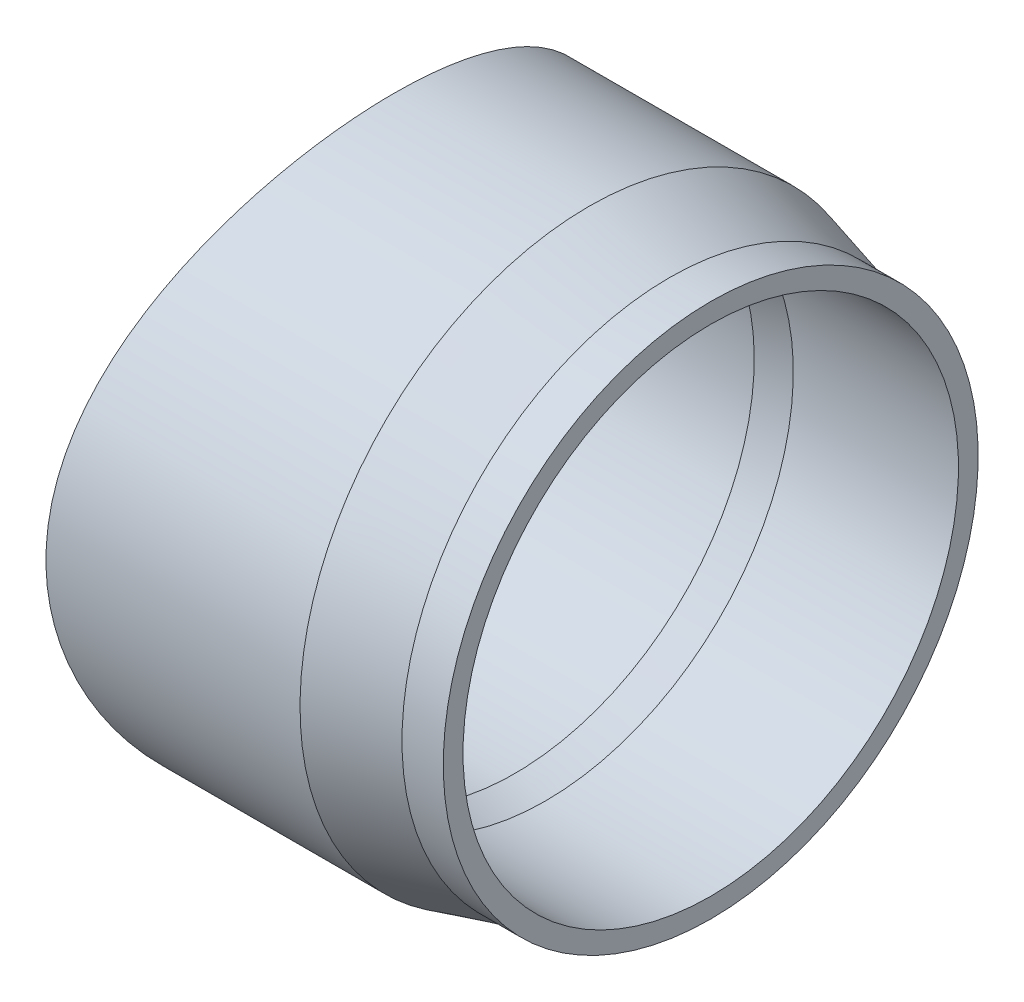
ISO-10303-21;
HEADER;
FILE_DESCRIPTION(('STEP AP214'),'2;1');
FILE_NAME('part.step','',(''),(''),'','','');
FILE_SCHEMA(('AUTOMOTIVE_DESIGN { 1 0 10303 214 1 1 1 1 }'));
ENDSEC;
DATA;
#1=APPLICATION_CONTEXT('core data for automotive mechanical design processes');
#2=APPLICATION_PROTOCOL_DEFINITION('international standard','automotive_design',2000,#1);
#3=PRODUCT_CONTEXT('',#1,'mechanical');
#4=PRODUCT('Part','Part','',(#3));
#5=PRODUCT_RELATED_PRODUCT_CATEGORY('part','',(#4));
#6=PRODUCT_DEFINITION_FORMATION('','',#4);
#7=PRODUCT_DEFINITION_CONTEXT('part definition',#1,'design');
#8=PRODUCT_DEFINITION('design','',#6,#7);
#9=PRODUCT_DEFINITION_SHAPE('','',#8);
#10=(LENGTH_UNIT() NAMED_UNIT(*) SI_UNIT(.MILLI.,.METRE.));
#11=(NAMED_UNIT(*) PLANE_ANGLE_UNIT() SI_UNIT($,.RADIAN.));
#12=(NAMED_UNIT(*) SI_UNIT($,.STERADIAN.) SOLID_ANGLE_UNIT());
#13=UNCERTAINTY_MEASURE_WITH_UNIT(LENGTH_MEASURE(1.E-05),#10,'distance_accuracy_value','');
#14=(GEOMETRIC_REPRESENTATION_CONTEXT(3) GLOBAL_UNCERTAINTY_ASSIGNED_CONTEXT((#13)) GLOBAL_UNIT_ASSIGNED_CONTEXT((#10,
#11,#12)) REPRESENTATION_CONTEXT('',''));
#15=CARTESIAN_POINT('',(0.,0.,0.));
#16=DIRECTION('',(0.,0.,1.));
#17=DIRECTION('',(1.,0.,0.));
#18=AXIS2_PLACEMENT_3D('',#15,#16,#17);
#19=CARTESIAN_POINT('',(0.,-175.,0.));
#20=DIRECTION('',(0.,1.,0.));
#21=DIRECTION('',(0.,0.,1.));
#22=AXIS2_PLACEMENT_3D('',#19,#20,#21);
#23=CYLINDRICAL_SURFACE('',#22,315.);
#24=CARTESIAN_POINT('',(315.,145.,0.));
#25=CARTESIAN_POINT('',(314.999998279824,144.999997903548,-1.92433460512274));
#26=CARTESIAN_POINT('',(314.982354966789,144.961680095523,-3.84877440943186));
#27=CARTESIAN_POINT('',(314.911890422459,144.808505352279,-7.69417260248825));
#28=CARTESIAN_POINT('',(314.859064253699,144.693637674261,-9.61513046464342));
#29=CARTESIAN_POINT('',(314.718550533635,144.387619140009,-13.450579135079));
#30=CARTESIAN_POINT('',(314.630847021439,144.196433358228,-15.365066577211));
#31=CARTESIAN_POINT('',(314.421158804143,143.73832667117,-19.183073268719));
#32=CARTESIAN_POINT('',(314.299173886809,143.471405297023,-21.0865924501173));
#33=CARTESIAN_POINT('',(314.021445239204,142.861967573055,-24.8829582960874));
#34=CARTESIAN_POINT('',(313.865634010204,142.519300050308,-26.7757757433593));
#35=CARTESIAN_POINT('',(313.521412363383,141.759622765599,-30.5434535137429));
#36=CARTESIAN_POINT('',(313.333001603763,141.342612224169,-32.4183136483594));
#37=CARTESIAN_POINT('',(312.924824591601,140.435429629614,-36.1465106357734));
#38=CARTESIAN_POINT('',(312.705062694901,139.945267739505,-37.9998504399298));
#39=CARTESIAN_POINT('',(312.235559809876,138.893003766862,-41.6821321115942));
#40=CARTESIAN_POINT('',(311.985818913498,138.330901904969,-43.5110740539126));
#41=CARTESIAN_POINT('',(311.458902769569,137.138372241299,-47.1348252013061));
#42=CARTESIAN_POINT('',(311.181833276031,136.508206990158,-48.929736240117));
#43=CARTESIAN_POINT('',(310.601150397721,135.179258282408,-52.4897944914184));
#44=CARTESIAN_POINT('',(310.297534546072,134.480468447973,-54.2549389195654));
#45=CARTESIAN_POINT('',(309.665625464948,133.015923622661,-57.7525618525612));
#46=CARTESIAN_POINT('',(309.337334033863,132.250173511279,-59.4850427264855));
#47=CARTESIAN_POINT('',(308.657959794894,130.653198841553,-62.9151893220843));
#48=CARTESIAN_POINT('',(308.306874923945,129.821968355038,-64.6128518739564));
#49=CARTESIAN_POINT('',(307.584116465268,128.096067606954,-67.9702795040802));
#50=CARTESIAN_POINT('',(307.212450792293,127.201421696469,-69.6300588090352));
#51=CARTESIAN_POINT('',(306.450500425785,125.349994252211,-72.9103996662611));
#52=CARTESIAN_POINT('',(306.060214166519,124.393207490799,-74.5309579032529));
#53=CARTESIAN_POINT('',(305.263278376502,122.419297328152,-77.7306178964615));
#54=CARTESIAN_POINT('',(304.856629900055,121.402177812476,-79.3097223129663));
#55=CARTESIAN_POINT('',(304.02917990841,119.309121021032,-82.4248460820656));
#56=CARTESIAN_POINT('',(303.608377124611,118.23317846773,-83.9608615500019));
#57=CARTESIAN_POINT('',(302.732140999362,115.965085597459,-87.0689111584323));
#58=CARTESIAN_POINT('',(302.276059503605,114.769797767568,-88.6384741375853));
#59=CARTESIAN_POINT('',(301.353558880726,112.317665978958,-91.7258344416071));
#60=CARTESIAN_POINT('',(300.887138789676,111.060816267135,-93.2436269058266));
#61=CARTESIAN_POINT('',(299.94686192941,108.487575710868,-96.2253773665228));
#62=CARTESIAN_POINT('',(299.473005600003,107.171188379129,-97.6893385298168));
#63=CARTESIAN_POINT('',(298.520747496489,104.480716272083,-100.561692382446));
#64=CARTESIAN_POINT('',(298.042345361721,103.106626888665,-101.970080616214));
#65=CARTESIAN_POINT('',(296.604156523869,98.898820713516,-106.11083778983));
#66=CARTESIAN_POINT('',(295.641731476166,95.9804985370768,-108.757718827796));
#67=CARTESIAN_POINT('',(294.21173176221,91.4472537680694,-112.544574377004));
#68=CARTESIAN_POINT('',(293.737274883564,89.9099933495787,-113.776436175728));
#69=CARTESIAN_POINT('',(292.795890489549,86.7850945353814,-116.177572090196));
#70=CARTESIAN_POINT('',(292.328962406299,85.1974599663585,-117.346850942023));
#71=CARTESIAN_POINT('',(291.376542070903,81.8717637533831,-119.692998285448));
#72=CARTESIAN_POINT('',(290.891744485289,80.1305401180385,-120.865666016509));
#73=CARTESIAN_POINT('',(289.937983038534,76.5958851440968,-123.136029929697));
#74=CARTESIAN_POINT('',(289.4690177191,74.8024586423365,-124.233733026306));
#75=CARTESIAN_POINT('',(288.550566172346,71.165480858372,-126.352301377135));
#76=CARTESIAN_POINT('',(288.101083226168,69.3219212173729,-127.373153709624));
#77=CARTESIAN_POINT('',(287.225481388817,65.5878855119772,-129.335521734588));
#78=CARTESIAN_POINT('',(286.799359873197,63.6974147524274,-130.277046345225));
#79=CARTESIAN_POINT('',(285.974274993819,59.8729570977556,-132.078367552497));
#80=CARTESIAN_POINT('',(285.575302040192,57.9389858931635,-132.938193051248));
#81=CARTESIAN_POINT('',(284.808002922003,54.0302714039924,-134.574209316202));
#82=CARTESIAN_POINT('',(284.439673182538,52.0555329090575,-135.350409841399));
#83=CARTESIAN_POINT('',(283.737084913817,48.0685323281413,-136.817133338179));
#84=CARTESIAN_POINT('',(283.402826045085,46.0562706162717,-137.507657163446));
#85=CARTESIAN_POINT('',(282.771660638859,41.9979704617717,-138.800957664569));
#86=CARTESIAN_POINT('',(282.474753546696,39.9519325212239,-139.403735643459));
#87=CARTESIAN_POINT('',(281.936509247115,35.9432986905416,-140.488971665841));
#88=CARTESIAN_POINT('',(281.693016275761,33.9822877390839,-140.976218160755));
#89=CARTESIAN_POINT('',(281.24439058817,30.0374283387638,-141.869103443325));
#90=CARTESIAN_POINT('',(281.039257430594,28.0535801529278,-142.274743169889));
#91=CARTESIAN_POINT('',(280.669347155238,24.0670152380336,-143.003092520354));
#92=CARTESIAN_POINT('',(280.504569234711,22.0642988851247,-143.325803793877));
#93=CARTESIAN_POINT('',(280.217005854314,18.0441138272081,-143.887209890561));
#94=CARTESIAN_POINT('',(280.094220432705,16.0266451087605,-144.125904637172));
#95=CARTESIAN_POINT('',(279.891955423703,11.9825882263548,-144.518310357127));
#96=CARTESIAN_POINT('',(279.812448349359,9.95600667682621,-144.672075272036));
#97=CARTESIAN_POINT('',(279.697439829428,5.89691008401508,-144.894298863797));
#98=CARTESIAN_POINT('',(279.661938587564,3.86439501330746,-144.96275714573));
#99=CARTESIAN_POINT('',(279.635311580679,-0.201875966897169,-145.014114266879));
#100=CARTESIAN_POINT('',(279.644183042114,-2.23563179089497,-144.997018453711));
#101=CARTESIAN_POINT('',(279.706204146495,-6.29992021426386,-144.877341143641));
#102=CARTESIAN_POINT('',(279.759352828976,-8.33045288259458,-144.774761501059));
#103=CARTESIAN_POINT('',(279.902042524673,-12.1857952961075,-144.498678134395));
#104=CARTESIAN_POINT('',(279.987522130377,-14.0113280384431,-144.333080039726));
#105=CARTESIAN_POINT('',(280.193360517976,-17.6528675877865,-143.93307946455));
#106=CARTESIAN_POINT('',(280.31371923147,-19.468874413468,-143.698677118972));
#107=CARTESIAN_POINT('',(280.588314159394,-23.088041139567,-143.161757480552));
#108=CARTESIAN_POINT('',(280.742547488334,-24.8912021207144,-142.859245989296));
#109=CARTESIAN_POINT('',(281.083653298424,-28.4818237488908,-142.18692590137));
#110=CARTESIAN_POINT('',(281.270525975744,-30.2692843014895,-141.81711690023));
#111=CARTESIAN_POINT('',(281.675462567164,-33.8258482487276,-141.011124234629));
#112=CARTESIAN_POINT('',(281.893530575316,-35.5949492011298,-140.574931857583));
#113=CARTESIAN_POINT('',(282.359184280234,-39.1119863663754,-139.637262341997));
#114=CARTESIAN_POINT('',(282.606772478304,-40.8599207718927,-139.135779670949));
#115=CARTESIAN_POINT('',(283.129592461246,-44.3318312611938,-138.068775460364));
#116=CARTESIAN_POINT('',(283.404822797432,-46.0558085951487,-137.50325727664));
#117=CARTESIAN_POINT('',(283.98097681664,-49.4776703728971,-136.30936916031));
#118=CARTESIAN_POINT('',(284.281902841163,-51.1755524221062,-135.680993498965));
#119=CARTESIAN_POINT('',(284.914442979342,-54.581156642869,-134.347746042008));
#120=CARTESIAN_POINT('',(285.246599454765,-56.2882240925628,-133.641459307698));
#121=CARTESIAN_POINT('',(285.933258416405,-59.6705187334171,-132.165933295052));
#122=CARTESIAN_POINT('',(286.287762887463,-61.3457430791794,-131.396688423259));
#123=CARTESIAN_POINT('',(287.016656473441,-64.6620235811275,-129.796808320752));
#124=CARTESIAN_POINT('',(287.39104373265,-66.3030829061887,-128.966178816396));
#125=CARTESIAN_POINT('',(288.157281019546,-69.549315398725,-127.244917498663));
#126=CARTESIAN_POINT('',(288.549132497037,-71.1544855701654,-126.35428070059));
#127=CARTESIAN_POINT('',(289.747372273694,-75.9142147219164,-123.594031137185));
#128=CARTESIAN_POINT('',(290.576361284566,-79.012611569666,-121.636263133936));
#129=CARTESIAN_POINT('',(292.274262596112,-85.0448471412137,-117.497904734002));
#130=CARTESIAN_POINT('',(293.143177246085,-87.9786761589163,-115.317301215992));
#131=CARTESIAN_POINT('',(294.993887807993,-93.9699117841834,-110.503112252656));
#132=CARTESIAN_POINT('',(295.977929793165,-97.0077602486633,-107.846007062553));
#133=CARTESIAN_POINT('',(297.9446447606,-102.852252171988,-102.287225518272));
#134=CARTESIAN_POINT('',(298.927317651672,-105.65888089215,-99.3855335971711));
#135=CARTESIAN_POINT('',(300.381109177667,-109.683067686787,-94.8614953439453));
#136=CARTESIAN_POINT('',(300.862478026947,-110.993869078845,-93.324412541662));
#137=CARTESIAN_POINT('',(301.815391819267,-113.551482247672,-90.1950283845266));
#138=CARTESIAN_POINT('',(302.286937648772,-114.798299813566,-88.6027320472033));
#139=CARTESIAN_POINT('',(303.217226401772,-117.226036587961,-85.3648146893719));
#140=CARTESIAN_POINT('',(303.675968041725,-118.406949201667,-83.7191883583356));
#141=CARTESIAN_POINT('',(304.577608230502,-120.700585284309,-80.3770850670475));
#142=CARTESIAN_POINT('',(305.020508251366,-121.81331509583,-78.6806128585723));
#143=CARTESIAN_POINT('',(305.902369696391,-124.005243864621,-75.1804960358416));
#144=CARTESIAN_POINT('',(306.340685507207,-125.082017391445,-73.3751686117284));
#145=CARTESIAN_POINT('',(307.194266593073,-127.158220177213,-69.7152313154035));
#146=CARTESIAN_POINT('',(307.60953172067,-128.157648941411,-67.8606211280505));
#147=CARTESIAN_POINT('',(308.414066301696,-130.076882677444,-64.1050057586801));
#148=CARTESIAN_POINT('',(308.803334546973,-130.996683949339,-62.2039984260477));
#149=CARTESIAN_POINT('',(309.55302897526,-132.754320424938,-58.3588801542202));
#150=CARTESIAN_POINT('',(309.913455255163,-133.592155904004,-56.4147693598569));
#151=CARTESIAN_POINT('',(310.602620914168,-135.183216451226,-52.4879359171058));
#152=CARTESIAN_POINT('',(310.931377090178,-135.936486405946,-50.5052344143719));
#153=CARTESIAN_POINT('',(311.554949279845,-137.356811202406,-46.5039068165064));
#154=CARTESIAN_POINT('',(311.849765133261,-138.023865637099,-44.4852805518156));
#155=CARTESIAN_POINT('',(312.403174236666,-139.269719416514,-40.4162370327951));
#156=CARTESIAN_POINT('',(312.661770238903,-139.848525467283,-38.3658222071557));
#157=CARTESIAN_POINT('',(313.140744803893,-140.916123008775,-34.2372918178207));
#158=CARTESIAN_POINT('',(313.361124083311,-141.404916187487,-32.1591767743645));
#159=CARTESIAN_POINT('',(313.747139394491,-142.258220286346,-28.1338559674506));
#160=CARTESIAN_POINT('',(313.915614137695,-142.629238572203,-26.188299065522));
#161=CARTESIAN_POINT('',(314.217119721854,-143.291609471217,-22.2809556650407));
#162=CARTESIAN_POINT('',(314.350151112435,-143.582963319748,-20.319169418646));
#163=CARTESIAN_POINT('',(314.579837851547,-144.085128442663,-16.3832689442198));
#164=CARTESIAN_POINT('',(314.676494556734,-144.295942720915,-14.4091551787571));
#165=CARTESIAN_POINT('',(314.832758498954,-144.636401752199,-10.4524682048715));
#166=CARTESIAN_POINT('',(314.892365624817,-144.766046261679,-8.46989497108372));
#167=CARTESIAN_POINT('',(314.974094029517,-144.943734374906,-4.50095712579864));
#168=CARTESIAN_POINT('',(314.996227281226,-144.991804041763,-2.51459392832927));
#169=CARTESIAN_POINT('',(315.002887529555,-145.006272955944,1.45849846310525));
#170=CARTESIAN_POINT('',(314.98741444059,-144.972672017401,3.44522765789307));
#171=CARTESIAN_POINT('',(314.918973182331,-144.823906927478,7.41492113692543));
#172=CARTESIAN_POINT('',(314.866006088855,-144.70874511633,9.39788552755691));
#173=CARTESIAN_POINT('',(314.722953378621,-144.397217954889,13.3560617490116));
#174=CARTESIAN_POINT('',(314.632868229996,-144.200853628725,15.331273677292));
#175=CARTESIAN_POINT('',(314.423092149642,-143.742546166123,19.1450127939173));
#176=CARTESIAN_POINT('',(314.305642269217,-143.485554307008,20.984260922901));
#177=CARTESIAN_POINT('',(314.039465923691,-142.901552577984,24.6493342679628));
#178=CARTESIAN_POINT('',(313.890739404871,-142.574542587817,26.4751594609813));
#179=CARTESIAN_POINT('',(313.562923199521,-141.851368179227,30.1101856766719));
#180=CARTESIAN_POINT('',(313.383835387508,-141.455208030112,31.9193877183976));
#181=CARTESIAN_POINT('',(312.996363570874,-140.594705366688,35.5183343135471));
#182=CARTESIAN_POINT('',(312.787979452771,-140.130362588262,37.30807879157));
#183=CARTESIAN_POINT('',(312.343145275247,-139.134606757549,40.8652983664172));
#184=CARTESIAN_POINT('',(312.106694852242,-138.603192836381,42.6327731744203));
#185=CARTESIAN_POINT('',(311.607087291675,-137.474481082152,46.1428877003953));
#186=CARTESIAN_POINT('',(311.343927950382,-136.877177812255,47.8855253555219));
#187=CARTESIAN_POINT('',(310.792443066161,-135.618077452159,51.3431794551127));
#188=CARTESIAN_POINT('',(310.504118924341,-134.956283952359,53.0581974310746));
#189=CARTESIAN_POINT('',(309.903891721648,-133.569505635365,56.4584694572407));
#190=CARTESIAN_POINT('',(309.591986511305,-132.844515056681,58.143720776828));
#191=CARTESIAN_POINT('',(308.936429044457,-131.309609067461,61.5333525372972));
#192=CARTESIAN_POINT('',(308.59209578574,-130.497768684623,63.236729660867));
#193=CARTESIAN_POINT('',(307.882207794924,-128.810092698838,66.6071497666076));
#194=CARTESIAN_POINT('',(307.516651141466,-127.9342513,68.2741894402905));
#195=CARTESIAN_POINT('',(306.766464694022,-126.120361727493,71.5694861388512));
#196=CARTESIAN_POINT('',(306.381836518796,-125.182318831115,73.1977464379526));
#197=CARTESIAN_POINT('',(305.595615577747,-123.245541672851,76.4137441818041));
#198=CARTESIAN_POINT('',(305.194021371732,-122.246802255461,78.0014781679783));
#199=CARTESIAN_POINT('',(304.376021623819,-120.190070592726,81.1348240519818));
#200=CARTESIAN_POINT('',(303.959612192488,-119.132062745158,82.6804246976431));
#201=CARTESIAN_POINT('',(303.114378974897,-116.958662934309,85.7273222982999));
#202=CARTESIAN_POINT('',(302.685554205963,-115.843266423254,87.228615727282));
#203=CARTESIAN_POINT('',(301.384033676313,-112.413580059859,91.6632530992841));
#204=CARTESIAN_POINT('',(300.496147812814,-110.01543456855,94.5279002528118));
#205=CARTESIAN_POINT('',(298.622380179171,-104.79390084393,100.297795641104));
#206=CARTESIAN_POINT('',(297.634627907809,-101.951680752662,103.185428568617));
#207=CARTESIAN_POINT('',(296.154133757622,-97.5152006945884,107.330728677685));
#208=CARTESIAN_POINT('',(295.660748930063,-96.0072703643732,108.681664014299));
#209=CARTESIAN_POINT('',(294.67761250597,-92.9355278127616,111.319742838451));
#210=CARTESIAN_POINT('',(294.187860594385,-91.3717205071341,112.606891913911));
#211=CARTESIAN_POINT('',(293.21505935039,-88.1893843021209,115.116206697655));
#212=CARTESIAN_POINT('',(292.732013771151,-86.5708263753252,116.338337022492));
#213=CARTESIAN_POINT('',(291.776308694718,-83.2819894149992,118.714893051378));
#214=CARTESIAN_POINT('',(291.303648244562,-81.6117151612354,119.86932498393));
#215=CARTESIAN_POINT('',(290.372024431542,-78.2212857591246,122.108797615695));
#216=CARTESIAN_POINT('',(289.913062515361,-76.5011253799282,123.193830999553));
#217=CARTESIAN_POINT('',(289.012347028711,-73.0135221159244,125.292325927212));
#218=CARTESIAN_POINT('',(288.570591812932,-71.2460837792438,126.305794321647));
#219=CARTESIAN_POINT('',(287.694701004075,-67.6124428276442,128.288615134));
#220=CARTESIAN_POINT('',(287.261191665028,-65.7448679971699,129.255731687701));
#221=CARTESIAN_POINT('',(286.419726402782,-61.9649427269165,131.109788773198));
#222=CARTESIAN_POINT('',(286.011767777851,-60.0525970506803,131.996737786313));
#223=CARTESIAN_POINT('',(285.224925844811,-56.1857793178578,133.688489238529));
#224=CARTESIAN_POINT('',(284.846045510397,-54.2313029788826,134.493283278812));
#225=CARTESIAN_POINT('',(284.120906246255,-50.2837303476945,136.018468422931));
#226=CARTESIAN_POINT('',(283.774647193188,-48.2906342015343,136.73885984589));
#227=CARTESIAN_POINT('',(283.118367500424,-44.2711835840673,138.092561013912));
#228=CARTESIAN_POINT('',(282.80831531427,-42.2448598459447,138.725946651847));
#229=CARTESIAN_POINT('',(282.227192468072,-38.161141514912,139.90440873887));
#230=CARTESIAN_POINT('',(281.956122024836,-36.1037467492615,140.4494846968));
#231=CARTESIAN_POINT('',(281.455797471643,-31.9623316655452,141.449449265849));
#232=CARTESIAN_POINT('',(281.226539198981,-29.8783140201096,141.904346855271));
#233=CARTESIAN_POINT('',(280.812263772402,-25.6880071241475,142.722398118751));
#234=CARTESIAN_POINT('',(280.627245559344,-23.5817184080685,143.085553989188));
#235=CARTESIAN_POINT('',(280.317846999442,-19.5394109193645,143.690672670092));
#236=CARTESIAN_POINT('',(280.189542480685,-17.6048700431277,143.940530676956));
#237=CARTESIAN_POINT('',(279.97254746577,-13.7250998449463,144.362145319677));
#238=CARTESIAN_POINT('',(279.883856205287,-11.779870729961,144.533903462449));
#239=CARTESIAN_POINT('',(279.746931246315,-7.88274002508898,144.798745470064));
#240=CARTESIAN_POINT('',(279.698695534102,-5.9308387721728,144.891833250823));
#241=CARTESIAN_POINT('',(279.643135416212,-2.02427598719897,144.999036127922));
#242=CARTESIAN_POINT('',(279.635811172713,-0.0696144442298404,145.013150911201));
#243=CARTESIAN_POINT('',(279.662141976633,3.83795588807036,144.962364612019));
#244=CARTESIAN_POINT('',(279.69578763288,5.79086497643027,144.897481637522));
#245=CARTESIAN_POINT('',(279.803719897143,9.69134824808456,144.688949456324));
#246=CARTESIAN_POINT('',(279.878006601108,11.6389224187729,144.545300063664));
#247=CARTESIAN_POINT('',(280.066511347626,15.5247146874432,144.179719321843));
#248=CARTESIAN_POINT('',(280.180728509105,17.462932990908,143.957789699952));
#249=CARTESIAN_POINT('',(280.448021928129,21.3261868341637,143.436372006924));
#250=CARTESIAN_POINT('',(280.601097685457,23.2512225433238,143.136884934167));
#251=CARTESIAN_POINT('',(280.932784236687,26.951546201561,142.484718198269));
#252=CARTESIAN_POINT('',(281.108889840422,28.7279655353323,142.137164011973));
#253=CARTESIAN_POINT('',(281.492176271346,32.2635059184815,141.376575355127));
#254=CARTESIAN_POINT('',(281.699359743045,34.0226254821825,140.963535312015));
#255=CARTESIAN_POINT('',(282.143179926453,37.5204352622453,140.073100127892));
#256=CARTESIAN_POINT('',(282.379812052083,39.2591286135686,139.595715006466));
#257=CARTESIAN_POINT('',(282.880828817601,42.7139896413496,138.577626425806));
#258=CARTESIAN_POINT('',(283.145215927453,44.4301552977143,138.036917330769));
#259=CARTESIAN_POINT('',(283.699863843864,47.837631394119,136.893356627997));
#260=CARTESIAN_POINT('',(283.990127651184,49.5289389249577,136.290497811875));
#261=CARTESIAN_POINT('',(284.59451603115,52.8844246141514,135.023900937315));
#262=CARTESIAN_POINT('',(284.908642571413,54.5486005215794,134.360157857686));
#263=CARTESIAN_POINT('',(285.558620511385,57.8475660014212,132.973157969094));
#264=CARTESIAN_POINT('',(285.894471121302,59.4823566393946,132.249903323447));
#265=CARTESIAN_POINT('',(286.585764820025,62.7208370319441,130.745114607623));
#266=CARTESIAN_POINT('',(286.941209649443,64.3245240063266,129.963575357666));
#267=CARTESIAN_POINT('',(287.693346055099,67.6030427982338,128.290429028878));
#268=CARTESIAN_POINT('',(288.091213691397,69.2756373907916,127.394964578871));
#269=CARTESIAN_POINT('',(288.903959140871,72.5814367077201,125.540937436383));
#270=CARTESIAN_POINT('',(289.318838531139,74.2146377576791,124.58236888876));
#271=CARTESIAN_POINT('',(290.162813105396,77.4395233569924,122.603826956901));
#272=CARTESIAN_POINT('',(290.591907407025,79.031210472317,121.583857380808));
#273=CARTESIAN_POINT('',(291.461596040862,82.1713976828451,119.484015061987));
#274=CARTESIAN_POINT('',(291.902191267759,83.7198943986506,118.404137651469));
#275=CARTESIAN_POINT('',(293.23736955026,88.2988177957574,115.076315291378));
#276=CARTESIAN_POINT('',(294.145215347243,91.2621867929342,112.740481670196));
#277=CARTESIAN_POINT('',(295.974294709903,96.9957111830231,107.847287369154));
#278=CARTESIAN_POINT('',(296.895528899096,99.7658575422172,105.289916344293));
#279=CARTESIAN_POINT('',(298.315777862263,103.895084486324,101.168585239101));
#280=CARTESIAN_POINT('',(298.817620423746,105.326537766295,99.6774536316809));
#281=CARTESIAN_POINT('',(299.815549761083,108.125265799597,96.6343584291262));
#282=CARTESIAN_POINT('',(300.311636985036,109.492545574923,95.0823996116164));
#283=CARTESIAN_POINT('',(301.294797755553,112.161018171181,91.9194658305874));
#284=CARTESIAN_POINT('',(301.781869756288,113.462199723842,90.308480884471));
#285=CARTESIAN_POINT('',(302.743591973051,115.99593126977,87.0300826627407));
#286=CARTESIAN_POINT('',(303.218243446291,117.228488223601,85.3626751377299));
#287=CARTESIAN_POINT('',(304.152269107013,119.623658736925,81.9724989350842));
#288=CARTESIAN_POINT('',(304.61163323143,120.786226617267,80.24969520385));
#289=CARTESIAN_POINT('',(305.511589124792,123.038190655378,76.7523861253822));
#290=CARTESIAN_POINT('',(305.952182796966,124.127594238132,74.9778860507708));
#291=CARTESIAN_POINT('',(306.811611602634,126.231083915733,71.3796633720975));
#292=CARTESIAN_POINT('',(307.230446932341,127.245170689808,69.5559412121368));
#293=CARTESIAN_POINT('',(308.043440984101,129.19577212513,65.86208878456));
#294=CARTESIAN_POINT('',(308.437599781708,130.132287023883,63.9919586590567));
#295=CARTESIAN_POINT('',(309.195720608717,131.919079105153,60.2218961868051));
#296=CARTESIAN_POINT('',(309.559878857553,132.769926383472,58.3222735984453));
#297=CARTESIAN_POINT('',(310.258530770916,134.390813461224,54.483484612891));
#298=CARTESIAN_POINT('',(310.593024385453,135.160853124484,52.5443181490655));
#299=CARTESIAN_POINT('',(311.229977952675,136.618186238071,48.6295607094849));
#300=CARTESIAN_POINT('',(311.532432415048,137.305465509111,46.6539635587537));
#301=CARTESIAN_POINT('',(312.103006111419,138.5951691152,42.6703881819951));
#302=CARTESIAN_POINT('',(312.371125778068,139.197594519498,40.6624103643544));
#303=CARTESIAN_POINT('',(312.870347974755,140.314302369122,36.623419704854));
#304=CARTESIAN_POINT('',(313.101547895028,140.828816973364,34.5924831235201));
#305=CARTESIAN_POINT('',(313.526047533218,141.77009199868,30.5063390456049));
#306=CARTESIAN_POINT('',(313.719345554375,142.196848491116,28.4511304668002));
#307=CARTESIAN_POINT('',(314.066430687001,142.960968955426,24.3221501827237));
#308=CARTESIAN_POINT('',(314.220241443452,143.29838642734,22.2483903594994));
#309=CARTESIAN_POINT('',(314.487279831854,143.882997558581,18.085871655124));
#310=CARTESIAN_POINT('',(314.600514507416,144.130206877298,15.997115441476));
#311=CARTESIAN_POINT('',(314.744031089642,144.443118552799,12.7487683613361));
#312=CARTESIAN_POINT('',(314.788736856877,144.540493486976,11.5927592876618));
#313=CARTESIAN_POINT('',(314.865444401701,144.707476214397,9.27856131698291));
#314=CARTESIAN_POINT('',(314.89744911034,144.777090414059,8.12037298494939));
#315=CARTESIAN_POINT('',(314.948689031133,144.888505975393,5.80235190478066));
#316=CARTESIAN_POINT('',(314.967923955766,144.930306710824,4.64251912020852));
#317=CARTESIAN_POINT('',(314.993581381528,144.986057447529,2.32180377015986));
#318=CARTESIAN_POINT('',(315.000001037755,145.000001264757,1.16092102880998));
#319=CARTESIAN_POINT('',(315.,145.,0.));
#320=B_SPLINE_CURVE_WITH_KNOTS('',3,(#24,#25,#26,#27,#28,#29,#30,#31,#32,#33,#34,#35,#36,#37,
#38,#39,#40,#41,#42,#43,#44,#45,#46,#47,#48,#49,#50,#51,#52,#53,#54,#55,#56,#57,#58,#59,#60,#61,
#62,#63,#64,#65,#66,#67,#68,#69,#70,#71,#72,#73,#74,#75,#76,#77,#78,#79,#80,#81,#82,#83,#84,#85,
#86,#87,#88,#89,#90,#91,#92,#93,#94,#95,#96,#97,#98,#99,#100,#101,#102,#103,#104,#105,#106,#107,
#108,#109,#110,#111,#112,#113,#114,#115,#116,#117,#118,#119,#120,#121,#122,#123,#124,#125,#126,
#127,#128,#129,#130,#131,#132,#133,#134,#135,#136,#137,#138,#139,#140,#141,#142,#143,#144,#145,
#146,#147,#148,#149,#150,#151,#152,#153,#154,#155,#156,#157,#158,#159,#160,#161,#162,#163,#164,
#165,#166,#167,#168,#169,#170,#171,#172,#173,#174,#175,#176,#177,#178,#179,#180,#181,#182,#183,
#184,#185,#186,#187,#188,#189,#190,#191,#192,#193,#194,#195,#196,#197,#198,#199,#200,#201,#202,
#203,#204,#205,#206,#207,#208,#209,#210,#211,#212,#213,#214,#215,#216,#217,#218,#219,#220,#221,
#222,#223,#224,#225,#226,#227,#228,#229,#230,#231,#232,#233,#234,#235,#236,#237,#238,#239,#240,
#241,#242,#243,#244,#245,#246,#247,#248,#249,#250,#251,#252,#253,#254,#255,#256,#257,#258,#259,
#260,#261,#262,#263,#264,#265,#266,#267,#268,#269,#270,#271,#272,#273,#274,#275,#276,#277,#278,
#279,#280,#281,#282,#283,#284,#285,#286,#287,#288,#289,#290,#291,#292,#293,#294,#295,#296,#297,
#298,#299,#300,#301,#302,#303,#304,#305,#306,#307,#308,#309,#310,#311,#312,#313,#314,#315,#316,
#317,#318,#319),.UNSPECIFIED.,.T.,.F.,(4,2,2,2,2,2,2,2,2,2,2,2,2,2,2,2,2,2,2,2,2,2,2,2,2,2,2,2,
2,2,2,2,2,2,2,2,2,2,2,2,2,2,2,2,2,2,2,2,2,2,2,2,2,2,2,2,2,2,2,2,2,2,2,2,2,2,2,2,2,2,2,2,2,2,2,2,
2,2,2,2,2,2,2,2,2,2,2,2,2,2,2,2,2,2,2,2,2,2,2,2,2,2,2,2,2,2,2,2,2,2,2,2,2,2,2,2,2,2,2,2,2,2,2,2,
2,2,2,2,2,2,2,2,2,2,2,2,2,2,2,2,2,2,2,2,2,2,2,4),(0.,5.77272441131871,11.5462591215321,
17.3224390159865,23.0986546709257,28.8865041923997,34.6744144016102,40.4615212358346,
46.2486103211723,52.0141235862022,57.7801731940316,63.545802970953,69.3119553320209,
75.0759054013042,80.8403409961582,86.6044057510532,92.3689885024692,98.4420527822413,
104.515685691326,110.588960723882,116.662721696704,128.814636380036,134.892238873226,
140.969380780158,147.431033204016,153.892088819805,160.354228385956,166.815640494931,
173.274758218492,179.733121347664,186.191420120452,192.649622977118,198.753310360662,
204.856927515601,210.96042324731,217.06392454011,223.16354483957,229.263193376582,
235.362460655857,241.461595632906,246.965033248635,252.468460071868,257.971418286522,
263.474409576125,268.97812373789,274.482304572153,279.986197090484,285.490591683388,
291.120196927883,296.750302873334,302.379884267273,308.009933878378,319.271323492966,
330.533376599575,342.982241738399,355.431899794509,361.660465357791,367.88846637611,
374.117089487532,380.345132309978,386.784875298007,393.224659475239,399.664742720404,
406.104804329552,412.541431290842,418.978088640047,425.414256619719,431.85030389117,
437.811677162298,443.772957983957,449.734016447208,455.695092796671,461.654264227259,
467.613449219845,473.572463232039,479.531402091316,485.11226220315,490.693131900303,
496.273657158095,501.854204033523,507.434823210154,513.015903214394,518.59667267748,
524.177951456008,529.930724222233,535.684018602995,541.436825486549,547.190121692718,
552.944939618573,558.700214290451,570.208761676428,582.705007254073,588.955053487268,
595.204551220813,601.457415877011,607.709704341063,613.962650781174,620.21499783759,
626.65493099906,633.094182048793,639.534090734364,645.97397507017,652.408205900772,
658.842472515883,665.276098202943,671.709569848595,677.572101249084,683.43451952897,
689.296645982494,695.158795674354,701.019601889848,706.880421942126,712.741112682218,
718.60172798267,724.056144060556,729.511024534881,734.965056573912,740.419574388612,
745.874725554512,751.330327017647,756.785730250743,762.241618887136,768.055534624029,
773.869990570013,779.684086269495,785.498635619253,797.129501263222,808.760910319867,
815.140493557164,821.519576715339,827.899743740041,834.279262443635,840.662900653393,
847.045890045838,853.428821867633,859.811734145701,866.148888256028,872.486053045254,
878.824302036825,885.162471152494,891.48363436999,897.805080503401,904.122732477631,
910.439287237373,913.921834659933,917.403577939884,920.885399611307,924.367994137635),.UNSPECIFIED.);
#321=CARTESIAN_POINT('',(295.134863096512,94.364121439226,110.092745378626));
#322=VERTEX_POINT('',#321);
#323=CARTESIAN_POINT('',(295.134879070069,94.3641713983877,-110.092702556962));
#324=VERTEX_POINT('',#323);
#325=EDGE_CURVE('E73',#322,#324,#320,.T.);
#326=ORIENTED_EDGE('',*,*,#325,.F.);
#327=CARTESIAN_POINT('',(295.134880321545,94.3641711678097,-110.092702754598));
#328=CARTESIAN_POINT('',(295.58161324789,95.8976802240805,-108.895135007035));
#329=CARTESIAN_POINT('',(296.031191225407,97.4070156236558,-107.667660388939));
#330=CARTESIAN_POINT('',(296.930398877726,100.365766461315,-105.162293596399));
#331=CARTESIAN_POINT('',(297.38000975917,101.815503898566,-103.884774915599));
#332=CARTESIAN_POINT('',(298.277613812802,104.65740715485,-101.278634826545));
#333=CARTESIAN_POINT('',(298.725606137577,106.049782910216,-99.9502420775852));
#334=CARTESIAN_POINT('',(299.617968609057,108.7775533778,-97.2425082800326));
#335=CARTESIAN_POINT('',(300.062345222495,110.113089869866,-95.8633122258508));
#336=CARTESIAN_POINT('',(300.945510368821,112.727215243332,-93.053610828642));
#337=CARTESIAN_POINT('',(301.384305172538,114.005872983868,-91.6231715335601));
#338=CARTESIAN_POINT('',(302.254272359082,116.506186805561,-88.7111494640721));
#339=CARTESIAN_POINT('',(302.685445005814,117.727844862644,-87.2295684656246));
#340=CARTESIAN_POINT('',(303.538517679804,120.114262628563,-84.2131645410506));
#341=CARTESIAN_POINT('',(303.960395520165,121.278892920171,-82.6782329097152));
#342=CARTESIAN_POINT('',(304.792745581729,123.55024680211,-79.5549571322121));
#343=CARTESIAN_POINT('',(305.203175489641,124.656766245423,-77.9664531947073));
#344=CARTESIAN_POINT('',(306.007261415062,126.801794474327,-74.7480508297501));
#345=CARTESIAN_POINT('',(306.400969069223,127.84051889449,-73.1183090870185));
#346=CARTESIAN_POINT('',(307.168063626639,129.845058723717,-69.8254337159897));
#347=CARTESIAN_POINT('',(307.541568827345,130.811315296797,-68.1625963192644));
#348=CARTESIAN_POINT('',(308.266575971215,132.671004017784,-64.8046573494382));
#349=CARTESIAN_POINT('',(308.618190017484,133.564815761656,-63.1097903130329));
#350=CARTESIAN_POINT('',(309.298408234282,135.280665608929,-59.6867653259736));
#351=CARTESIAN_POINT('',(309.627084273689,136.102930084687,-57.9587351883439));
#352=CARTESIAN_POINT('',(310.259915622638,137.675471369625,-54.4694790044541));
#353=CARTESIAN_POINT('',(310.5641121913,138.425869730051,-52.7083152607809));
#354=CARTESIAN_POINT('',(311.146651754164,139.854259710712,-49.1523771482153));
#355=CARTESIAN_POINT('',(311.42499133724,140.532241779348,-47.3575983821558));
#356=CARTESIAN_POINT('',(311.954404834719,141.815047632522,-43.7351302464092));
#357=CARTESIAN_POINT('',(312.20543886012,142.4197645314,-41.9073971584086));
#358=CARTESIAN_POINT('',(312.678966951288,143.555394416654,-38.2144275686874));
#359=CARTESIAN_POINT('',(312.901298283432,144.085887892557,-36.3490411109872));
#360=CARTESIAN_POINT('',(313.315060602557,145.069325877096,-32.5907204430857));
#361=CARTESIAN_POINT('',(313.50643230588,145.522121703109,-30.6977407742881));
#362=CARTESIAN_POINT('',(313.855132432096,146.344724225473,-26.8998938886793));
#363=CARTESIAN_POINT('',(314.012613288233,146.7149028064,-24.9951213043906));
#364=CARTESIAN_POINT('',(314.292790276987,147.371880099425,-21.1815576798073));
#365=CARTESIAN_POINT('',(314.415706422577,147.659206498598,-19.2728737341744));
#366=CARTESIAN_POINT('',(314.626711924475,148.151624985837,-15.449772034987));
#367=CARTESIAN_POINT('',(314.714920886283,148.356999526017,-13.535397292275));
#368=CARTESIAN_POINT('',(314.856420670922,148.686179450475,-9.70107577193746));
#369=CARTESIAN_POINT('',(314.909760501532,148.810099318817,-7.78114064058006));
#370=CARTESIAN_POINT('',(314.981289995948,148.976131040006,-3.93590294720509));
#371=CARTESIAN_POINT('',(314.999458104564,149.018192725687,-2.0105978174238));
#372=CARTESIAN_POINT('',(315.000520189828,149.020655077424,1.84487778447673));
#373=CARTESIAN_POINT('',(314.983326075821,148.980851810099,3.77504841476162));
#374=CARTESIAN_POINT('',(314.913328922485,148.818385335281,7.64124578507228));
#375=CARTESIAN_POINT('',(314.860342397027,148.695295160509,9.57725127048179));
#376=CARTESIAN_POINT('',(314.718604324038,148.365575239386,13.4530670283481));
#377=CARTESIAN_POINT('',(314.62963042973,148.158426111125,15.3928249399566));
#378=CARTESIAN_POINT('',(314.416891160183,147.661973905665,19.2543078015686));
#379=CARTESIAN_POINT('',(314.293224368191,147.372903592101,21.1760681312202));
#380=CARTESIAN_POINT('',(314.012506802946,146.714649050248,24.9955997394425));
#381=CARTESIAN_POINT('',(313.855587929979,146.345781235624,26.8934352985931));
#382=CARTESIAN_POINT('',(313.509578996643,145.529553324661,30.664725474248));
#383=CARTESIAN_POINT('',(313.320561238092,145.08236956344,32.5382249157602));
#384=CARTESIAN_POINT('',(312.911467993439,144.110132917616,36.2618269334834));
#385=CARTESIAN_POINT('',(312.6913868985,143.585065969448,38.1119252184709));
#386=CARTESIAN_POINT('',(312.221354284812,142.458050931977,41.7884254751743));
#387=CARTESIAN_POINT('',(311.971349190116,141.855964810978,43.6147782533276));
#388=CARTESIAN_POINT('',(311.442461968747,140.57476142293,47.2441044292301));
#389=CARTESIAN_POINT('',(311.163471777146,139.895354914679,49.0469599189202));
#390=CARTESIAN_POINT('',(310.577205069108,138.458150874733,52.6321833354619));
#391=CARTESIAN_POINT('',(310.269735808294,137.699814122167,54.4143034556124));
#392=CARTESIAN_POINT('',(309.629692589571,136.109483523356,57.9453419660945));
#393=CARTESIAN_POINT('',(309.297067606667,135.277339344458,59.6941833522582));
#394=CARTESIAN_POINT('',(308.610365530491,133.544995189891,63.148326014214));
#395=CARTESIAN_POINT('',(308.256339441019,132.644955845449,64.8537180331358));
#396=CARTESIAN_POINT('',(307.529215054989,130.779441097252,68.2183371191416));
#397=CARTESIAN_POINT('',(307.156167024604,129.814136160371,69.8776696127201));
#398=CARTESIAN_POINT('',(306.392604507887,127.818385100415,73.1528080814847));
#399=CARTESIAN_POINT('',(306.002088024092,126.787931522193,74.7686090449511));
#400=CARTESIAN_POINT('',(305.205678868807,124.663372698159,77.9561542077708));
#401=CARTESIAN_POINT('',(304.799772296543,123.56920940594,79.5278562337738));
#402=CARTESIAN_POINT('',(303.97388793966,121.316002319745,82.6286927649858));
#403=CARTESIAN_POINT('',(303.553867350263,120.156752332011,84.1576659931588));
#404=CARTESIAN_POINT('',(302.701584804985,117.773352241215,87.1734806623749));
#405=CARTESIAN_POINT('',(302.269272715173,116.548910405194,88.660077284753));
#406=CARTESIAN_POINT('',(301.394536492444,114.03561916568,91.5897117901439));
#407=CARTESIAN_POINT('',(300.952069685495,112.746451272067,93.0324636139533));
#408=CARTESIAN_POINT('',(300.061150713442,110.109610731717,95.8672829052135));
#409=CARTESIAN_POINT('',(299.612688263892,108.761825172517,97.2592421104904));
#410=CARTESIAN_POINT('',(298.714475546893,106.015459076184,99.9837199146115));
#411=CARTESIAN_POINT('',(298.264731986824,104.617024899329,101.316388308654));
#412=CARTESIAN_POINT('',(297.366336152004,101.771438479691,103.923315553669));
#413=CARTESIAN_POINT('',(296.91768340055,100.324381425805,105.197678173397));
#414=CARTESIAN_POINT('',(296.023363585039,97.3809009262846,107.688794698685));
#415=CARTESIAN_POINT('',(295.577696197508,95.8844829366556,108.905554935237));
#416=CARTESIAN_POINT('',(295.134836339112,94.3641263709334,110.092741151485));
#417=B_SPLINE_CURVE_WITH_KNOTS('',3,(#327,#328,#329,#330,#331,#332,#333,#334,#335,#336,#337,
#338,#339,#340,#341,#342,#343,#344,#345,#346,#347,#348,#349,#350,#351,#352,#353,#354,#355,#356,
#357,#358,#359,#360,#361,#362,#363,#364,#365,#366,#367,#368,#369,#370,#371,#372,#373,#374,#375,
#376,#377,#378,#379,#380,#381,#382,#383,#384,#385,#386,#387,#388,#389,#390,#391,#392,#393,#394,
#395,#396,#397,#398,#399,#400,#401,#402,#403,#404,#405,#406,#407,#408,#409,#410,#411,#412,#413,
#414,#415,#416),.UNSPECIFIED.,.F.,.F.,(4,2,2,2,2,2,2,2,2,2,2,2,2,2,2,2,2,2,2,2,2,2,2,2,2,2,2,2,
2,2,2,2,2,2,2,2,2,2,2,2,2,2,2,2,4),(0.,5.98867130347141,11.9389658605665,17.8650902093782,
23.7754436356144,29.6784354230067,35.5812224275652,41.4968369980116,47.4320066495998,
53.347272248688,59.2229755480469,65.0655775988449,70.8889653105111,76.7023228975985,
82.5164463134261,88.3389522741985,94.1931414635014,100.058411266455,105.896721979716,
111.696982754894,117.477076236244,123.249028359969,129.02451673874,134.814409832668,
140.63421176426,146.490534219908,152.330381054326,158.147482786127,163.951651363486,
169.7568692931,175.572640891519,181.410931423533,187.292112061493,193.185559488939,
199.065476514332,204.930588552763,210.796372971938,216.667588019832,222.558586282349,
228.47862175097,234.431367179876,240.396136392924,246.34486355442,252.282555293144,
258.219592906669),.UNSPECIFIED.);
#418=EDGE_CURVE('E65',#322,#324,#417,.F.);
#419=ORIENTED_EDGE('',*,*,#418,.T.);
#420=EDGE_LOOP('',(#326,#419));
#421=FACE_BOUND('',#420,.T.);
#422=ADVANCED_FACE('F27',(#421),#23,.F.);
#423=CARTESIAN_POINT('',(522.,0.,0.));
#424=DIRECTION('',(1.,0.,0.));
#425=DIRECTION('',(0.,1.,0.));
#426=AXIS2_PLACEMENT_3D('',#423,#424,#425);
#427=PLANE('',#426);
#428=CARTESIAN_POINT('',(522.,0.,0.));
#429=DIRECTION('',(1.,0.,0.));
#430=DIRECTION('',(0.,1.,0.));
#431=AXIS2_PLACEMENT_3D('',#428,#429,#430);
#432=CIRCLE('',#431,150.);
#433=CARTESIAN_POINT('',(522.,150.,0.));
#434=VERTEX_POINT('',#433);
#435=EDGE_CURVE('E153',#434,#434,#432,.T.);
#436=ORIENTED_EDGE('',*,*,#435,.F.);
#437=EDGE_LOOP('',(#436));
#438=FACE_BOUND('',#437,.T.);
#439=CARTESIAN_POINT('',(522.,0.,0.));
#440=DIRECTION('',(1.,0.,0.));
#441=DIRECTION('',(0.,1.,0.));
#442=AXIS2_PLACEMENT_3D('',#439,#440,#441);
#443=CIRCLE('',#442,161.95);
#444=CARTESIAN_POINT('',(522.,161.95,0.));
#445=VERTEX_POINT('',#444);
#446=EDGE_CURVE('E161',#445,#445,#443,.T.);
#447=ORIENTED_EDGE('',*,*,#446,.T.);
#448=EDGE_LOOP('',(#447));
#449=FACE_BOUND('',#448,.T.);
#450=ADVANCED_FACE('F29',(#438,#449),#427,.T.);
#451=CARTESIAN_POINT('',(561.325895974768,0.,0.));
#452=DIRECTION('',(1.,0.,0.));
#453=DIRECTION('',(0.,1.,0.));
#454=AXIS2_PLACEMENT_3D('',#451,#452,#453);
#455=CYLINDRICAL_SURFACE('',#454,161.95);
#456=CARTESIAN_POINT('',(497.,0.,0.));
#457=DIRECTION('',(1.,0.,0.));
#458=DIRECTION('',(0.,1.,0.));
#459=AXIS2_PLACEMENT_3D('',#456,#457,#458);
#460=CIRCLE('',#459,161.95);
#461=CARTESIAN_POINT('',(497.,161.95,0.));
#462=VERTEX_POINT('',#461);
#463=EDGE_CURVE('E159',#462,#462,#460,.T.);
#464=ORIENTED_EDGE('',*,*,#463,.T.);
#465=EDGE_LOOP('',(#464));
#466=FACE_BOUND('',#465,.T.);
#467=ORIENTED_EDGE('',*,*,#446,.F.);
#468=EDGE_LOOP('',(#467));
#469=FACE_BOUND('',#468,.T.);
#470=ADVANCED_FACE('F166',(#466,#469),#455,.T.);
#471=CARTESIAN_POINT('',(497.,0.,0.));
#472=DIRECTION('',(-1.,0.,0.));
#473=DIRECTION('',(0.,-1.,0.));
#474=AXIS2_PLACEMENT_3D('',#471,#472,#473);
#475=CONICAL_SURFACE('',#474,161.95,0.261799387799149);
#476=CARTESIAN_POINT('',(448.296736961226,0.,0.));
#477=DIRECTION('',(1.,0.,0.));
#478=DIRECTION('',(0.,1.,0.));
#479=AXIS2_PLACEMENT_3D('',#476,#477,#478);
#480=CIRCLE('',#479,175.);
#481=CARTESIAN_POINT('',(448.296736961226,175.,0.));
#482=VERTEX_POINT('',#481);
#483=EDGE_CURVE('E156',#482,#482,#480,.T.);
#484=ORIENTED_EDGE('',*,*,#483,.T.);
#485=EDGE_LOOP('',(#484));
#486=FACE_BOUND('',#485,.T.);
#487=ORIENTED_EDGE('',*,*,#463,.F.);
#488=EDGE_LOOP('',(#487));
#489=FACE_BOUND('',#488,.T.);
#490=ADVANCED_FACE('F168',(#486,#489),#475,.T.);
#491=CARTESIAN_POINT('',(561.325895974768,0.,0.));
#492=DIRECTION('',(1.,0.,0.));
#493=DIRECTION('',(0.,1.,0.));
#494=AXIS2_PLACEMENT_3D('',#491,#492,#493);
#495=CYLINDRICAL_SURFACE('',#494,175.);
#496=CARTESIAN_POINT('',(329.999902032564,174.999999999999,0.));
#497=CARTESIAN_POINT('',(329.999903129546,175.000006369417,-5.77932713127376));
#498=CARTESIAN_POINT('',(329.889869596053,174.714414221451,-11.5390116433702));
#499=CARTESIAN_POINT('',(329.453548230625,173.575287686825,-23.0193960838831));
#500=CARTESIAN_POINT('',(329.127579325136,172.722631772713,-28.7339985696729));
#501=CARTESIAN_POINT('',(328.260626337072,170.432265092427,-40.1479058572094));
#502=CARTESIAN_POINT('',(327.72010966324,168.995348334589,-45.8129580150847));
#503=CARTESIAN_POINT('',(326.469232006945,165.622737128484,-56.8064206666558));
#504=CARTESIAN_POINT('',(325.754970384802,163.676808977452,-62.187914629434));
#505=CARTESIAN_POINT('',(324.17321989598,159.287034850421,-72.698539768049));
#506=CARTESIAN_POINT('',(323.304724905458,156.840510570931,-77.8354059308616));
#507=CARTESIAN_POINT('',(321.436404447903,151.452171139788,-87.8619760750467));
#508=CARTESIAN_POINT('',(320.430864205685,148.493239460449,-92.7769640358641));
#509=CARTESIAN_POINT('',(318.326572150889,142.114641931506,-102.279590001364));
#510=CARTESIAN_POINT('',(317.239465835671,138.730812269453,-106.820455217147));
#511=CARTESIAN_POINT('',(315.016594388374,131.559992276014,-115.537096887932));
#512=CARTESIAN_POINT('',(313.882088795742,127.777102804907,-119.706944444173));
#513=CARTESIAN_POINT('',(311.596182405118,119.813110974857,-127.677545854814));
#514=CARTESIAN_POINT('',(310.445789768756,115.636072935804,-131.47472485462));
#515=CARTESIAN_POINT('',(308.154381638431,106.85044442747,-138.709933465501));
#516=CARTESIAN_POINT('',(307.020943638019,102.266680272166,-142.122391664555));
#517=CARTESIAN_POINT('',(304.844814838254,92.8551588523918,-148.441659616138));
#518=CARTESIAN_POINT('',(303.795015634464,88.0006439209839,-151.370845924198));
#519=CARTESIAN_POINT('',(301.807755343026,78.0024974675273,-156.757304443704));
#520=CARTESIAN_POINT('',(300.869909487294,72.8575164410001,-159.215786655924));
#521=CARTESIAN_POINT('',(299.137629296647,62.2506226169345,-163.655380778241));
#522=CARTESIAN_POINT('',(298.344604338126,56.7824603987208,-165.632326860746));
#523=CARTESIAN_POINT('',(296.970580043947,45.7802276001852,-169.003139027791));
#524=CARTESIAN_POINT('',(296.381491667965,40.198817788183,-170.417873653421));
#525=CARTESIAN_POINT('',(295.425068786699,28.9025661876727,-172.692893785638));
#526=CARTESIAN_POINT('',(295.057135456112,23.1812055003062,-173.554800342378));
#527=CARTESIAN_POINT('',(294.56097554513,11.5952266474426,-174.713199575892));
#528=CARTESIAN_POINT('',(294.435120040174,5.69885636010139,-175.004326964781));
#529=CARTESIAN_POINT('',(294.438881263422,-5.91133266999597,-174.995608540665));
#530=CARTESIAN_POINT('',(294.564846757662,-11.6888184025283,-174.704187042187));
#531=CARTESIAN_POINT('',(295.056038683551,-23.152424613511,-173.557335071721));
#532=CARTESIAN_POINT('',(295.421255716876,-28.8477253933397,-172.701859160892));
#533=CARTESIAN_POINT('',(296.376480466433,-40.1493580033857,-170.429897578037));
#534=CARTESIAN_POINT('',(296.970417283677,-45.7867253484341,-169.003789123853));
#535=CARTESIAN_POINT('',(298.35734022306,-56.8765590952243,-165.600828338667));
#536=CARTESIAN_POINT('',(299.139545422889,-62.2578502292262,-163.650132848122));
#537=CARTESIAN_POINT('',(300.853650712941,-72.7624208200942,-159.257789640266));
#538=CARTESIAN_POINT('',(301.784511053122,-77.8774517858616,-156.818721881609));
#539=CARTESIAN_POINT('',(303.762307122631,-87.8439601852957,-151.461043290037));
#540=CARTESIAN_POINT('',(304.809391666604,-92.6952686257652,-148.54191426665));
#541=CARTESIAN_POINT('',(306.989557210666,-102.137450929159,-142.216080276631));
#542=CARTESIAN_POINT('',(308.12639502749,-106.738539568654,-138.795117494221));
#543=CARTESIAN_POINT('',(310.403050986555,-115.476638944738,-131.612749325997));
#544=CARTESIAN_POINT('',(311.552532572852,-119.656545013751,-127.824105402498));
#545=CARTESIAN_POINT('',(313.837035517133,-127.62446251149,-119.869461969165));
#546=CARTESIAN_POINT('',(314.97383716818,-131.418912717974,-115.697569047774));
#547=CARTESIAN_POINT('',(317.202839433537,-138.615702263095,-106.971033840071));
#548=CARTESIAN_POINT('',(318.301934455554,-142.038622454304,-102.385353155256));
#549=CARTESIAN_POINT('',(320.404468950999,-148.414531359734,-92.9015266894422));
#550=CARTESIAN_POINT('',(321.401926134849,-151.351215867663,-88.0349264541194));
#551=CARTESIAN_POINT('',(323.271921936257,-156.747368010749,-78.0230833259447));
#552=CARTESIAN_POINT('',(324.14360539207,-159.204086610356,-72.8822061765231));
#553=CARTESIAN_POINT('',(325.73657403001,-163.626492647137,-62.3228865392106));
#554=CARTESIAN_POINT('',(326.458743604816,-165.594446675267,-56.8974084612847));
#555=CARTESIAN_POINT('',(327.724480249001,-169.007143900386,-45.7757408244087));
#556=CARTESIAN_POINT('',(328.258556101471,-170.426752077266,-40.1691800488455));
#557=CARTESIAN_POINT('',(329.546989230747,-173.830737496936,-23.2238501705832));
#558=CARTESIAN_POINT('',(329.998582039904,-174.996646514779,-11.720169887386));
#559=CARTESIAN_POINT('',(330.000561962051,-175.001676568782,5.85053195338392));
#560=CARTESIAN_POINT('',(329.886658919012,-174.706086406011,11.713002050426));
#561=CARTESIAN_POINT('',(329.436364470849,-173.530367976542,23.3779061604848));
#562=CARTESIAN_POINT('',(329.10232352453,-172.656257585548,29.1246181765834));
#563=CARTESIAN_POINT('',(328.235514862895,-170.365551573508,40.4170128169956));
#564=CARTESIAN_POINT('',(327.703003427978,-168.949540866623,45.9758283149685));
#565=CARTESIAN_POINT('',(326.455831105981,-165.586284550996,56.9113988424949));
#566=CARTESIAN_POINT('',(325.74028429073,-163.636552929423,62.2949265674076));
#567=CARTESIAN_POINT('',(324.146463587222,-159.21226117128,72.8666183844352));
#568=CARTESIAN_POINT('',(323.25868340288,-156.710042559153,78.1015894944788));
#569=CARTESIAN_POINT('',(321.377303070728,-151.279270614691,88.1589980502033));
#570=CARTESIAN_POINT('',(320.379948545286,-148.341021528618,93.0152659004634));
#571=CARTESIAN_POINT('',(318.300866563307,-142.03452435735,102.386991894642));
#572=CARTESIAN_POINT('',(317.218834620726,-138.665749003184,106.904705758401));
#573=CARTESIAN_POINT('',(314.996913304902,-131.49498464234,115.610862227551));
#574=CARTESIAN_POINT('',(313.857787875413,-127.695813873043,119.796484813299));
#575=CARTESIAN_POINT('',(310.390637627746,-115.606123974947,131.87125236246));
#576=CARTESIAN_POINT('',(308.080611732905,-106.852767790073,139.046603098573));
#577=CARTESIAN_POINT('',(304.830701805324,-92.7925149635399,148.481936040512));
#578=CARTESIAN_POINT('',(303.779805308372,-87.9296961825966,151.41326354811));
#579=CARTESIAN_POINT('',(301.779181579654,-77.8530253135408,156.833535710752));
#580=CARTESIAN_POINT('',(300.8325365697,-72.6445802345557,159.312988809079));
#581=CARTESIAN_POINT('',(299.114005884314,-62.089492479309,163.714455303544));
#582=CARTESIAN_POINT('',(298.334254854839,-56.7042126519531,165.657847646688));
#583=CARTESIAN_POINT('',(296.965743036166,-45.7368407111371,169.014873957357));
#584=CARTESIAN_POINT('',(296.376602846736,-40.1536355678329,170.429673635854));
#585=CARTESIAN_POINT('',(295.414040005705,-28.7594931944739,172.718954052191));
#586=CARTESIAN_POINT('',(295.044013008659,-22.9527824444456,173.585520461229));
#587=CARTESIAN_POINT('',(294.557266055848,-11.4278436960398,174.721775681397));
#588=CARTESIAN_POINT('',(294.435330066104,-5.65249883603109,175.003844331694));
#589=CARTESIAN_POINT('',(294.438677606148,5.88806247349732,174.996076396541));
#590=CARTESIAN_POINT('',(294.564055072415,11.6658687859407,174.706016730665));
#591=CARTESIAN_POINT('',(295.057752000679,23.1968769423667,173.553353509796));
#592=CARTESIAN_POINT('',(295.432268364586,29.0143151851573,172.675997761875));
#593=CARTESIAN_POINT('',(296.398669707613,40.374399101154,170.376777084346));
#594=CARTESIAN_POINT('',(296.988933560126,45.9410602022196,168.958651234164));
#595=CARTESIAN_POINT('',(298.355849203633,56.8582882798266,165.6041888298));
#596=CARTESIAN_POINT('',(299.132278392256,62.2092729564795,163.66838716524));
#597=CARTESIAN_POINT('',(300.843300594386,72.7029939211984,159.284674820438));
#598=CARTESIAN_POINT('',(301.77663396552,77.8390964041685,156.840214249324));
#599=CARTESIAN_POINT('',(303.779758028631,87.93055305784,151.413615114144));
#600=CARTESIAN_POINT('',(304.837989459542,92.8264440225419,148.461430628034));
#601=CARTESIAN_POINT('',(308.094823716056,106.909473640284,139.004041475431));
#602=CARTESIAN_POINT('',(310.389721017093,115.597591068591,131.867845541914));
#603=CARTESIAN_POINT('',(313.8308497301,127.604522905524,119.893576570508));
#604=CARTESIAN_POINT('',(314.982737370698,131.449040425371,115.665701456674));
#605=CARTESIAN_POINT('',(317.220330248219,138.67076794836,106.899545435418));
#606=CARTESIAN_POINT('',(318.307427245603,142.055073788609,102.359879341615));
#607=CARTESIAN_POINT('',(320.388374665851,148.365928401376,92.9748116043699));
#608=CARTESIAN_POINT('',(321.385455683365,151.303045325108,88.1177815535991));
#609=CARTESIAN_POINT('',(323.259899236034,156.713308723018,78.0927043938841));
#610=CARTESIAN_POINT('',(324.141510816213,159.198500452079,72.8989421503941));
#611=CARTESIAN_POINT('',(325.748634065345,163.659743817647,62.2400755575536));
#612=CARTESIAN_POINT('',(326.464245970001,165.609187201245,56.8467705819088));
#613=CARTESIAN_POINT('',(327.713957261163,168.978866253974,45.8704844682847));
#614=CARTESIAN_POINT('',(328.24660380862,170.394965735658,40.2971773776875));
#615=CARTESIAN_POINT('',(329.111503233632,172.680405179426,28.9797298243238));
#616=CARTESIAN_POINT('',(329.444264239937,173.551033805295,23.2234661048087));
#617=CARTESIAN_POINT('',(329.890125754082,174.715098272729,11.5716664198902));
#618=CARTESIAN_POINT('',(329.999900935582,174.999993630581,5.77932713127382));
#619=CARTESIAN_POINT('',(329.999902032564,174.999999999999,0.));
#620=B_SPLINE_CURVE_WITH_KNOTS('',3,(#496,#497,#498,#499,#500,#501,#502,#503,#504,#505,#506,
#507,#508,#509,#510,#511,#512,#513,#514,#515,#516,#517,#518,#519,#520,#521,#522,#523,#524,#525,
#526,#527,#528,#529,#530,#531,#532,#533,#534,#535,#536,#537,#538,#539,#540,#541,#542,#543,#544,
#545,#546,#547,#548,#549,#550,#551,#552,#553,#554,#555,#556,#557,#558,#559,#560,#561,#562,#563,
#564,#565,#566,#567,#568,#569,#570,#571,#572,#573,#574,#575,#576,#577,#578,#579,#580,#581,#582,
#583,#584,#585,#586,#587,#588,#589,#590,#591,#592,#593,#594,#595,#596,#597,#598,#599,#600,#601,
#602,#603,#604,#605,#606,#607,#608,#609,#610,#611,#612,#613,#614,#615,#616,#617,#618,#619),
.UNSPECIFIED.,.T.,.F.,(4,2,2,2,2,2,2,2,2,2,2,2,2,2,2,2,2,2,2,2,2,2,2,2,2,2,2,2,2,2,2,2,2,2,2,2,
2,2,2,2,2,2,2,2,2,2,2,2,2,2,2,2,2,2,2,2,2,2,2,2,2,4),(-0.910026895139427,-0.895291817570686,
-0.880556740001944,-0.865821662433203,-0.851086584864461,-0.83635150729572,-0.821616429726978,
-0.806881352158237,-0.792146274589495,-0.777411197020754,-0.762676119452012,-0.747941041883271,
-0.733205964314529,-0.718470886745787,-0.703735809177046,-0.689000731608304,-0.674265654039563,
-0.659530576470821,-0.64479549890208,-0.630060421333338,-0.615325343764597,-0.600590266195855,
-0.585855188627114,-0.571120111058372,-0.556385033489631,-0.541649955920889,-0.526914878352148,
-0.512179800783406,-0.497444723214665,-0.482709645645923,-0.467974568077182,-0.438504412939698,
-0.423769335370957,-0.409034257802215,-0.394299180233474,-0.379564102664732,-0.364829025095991,
-0.350093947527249,-0.335358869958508,-0.320623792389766,-0.291153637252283,-0.276418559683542,
-0.2616834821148,-0.246948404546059,-0.232213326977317,-0.217478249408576,-0.202743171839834,
-0.188008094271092,-0.173273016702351,-0.158537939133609,-0.143802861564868,-0.129067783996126,
-0.114332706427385,-0.0848625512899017,-0.0701274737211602,-0.0553923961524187,
-0.0406573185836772,-0.0259222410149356,-0.0111871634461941,0.00354791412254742,
0.018282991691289,0.0330180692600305),.UNSPECIFIED.);
#621=CARTESIAN_POINT('',(329.999902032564,174.999999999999,0.));
#622=VERTEX_POINT('',#621);
#623=EDGE_CURVE('E11',#622,#622,#620,.F.);
#624=ORIENTED_EDGE('',*,*,#623,.T.);
#625=EDGE_LOOP('',(#624));
#626=FACE_BOUND('',#625,.T.);
#627=ORIENTED_EDGE('',*,*,#483,.F.);
#628=EDGE_LOOP('',(#627));
#629=FACE_BOUND('',#628,.T.);
#630=ADVANCED_FACE('F134',(#626,#629),#495,.T.);
#631=CARTESIAN_POINT('',(422.,0.,0.));
#632=DIRECTION('',(1.,0.,0.));
#633=DIRECTION('',(0.,1.,0.));
#634=AXIS2_PLACEMENT_3D('',#631,#632,#633);
#635=CYLINDRICAL_SURFACE('',#634,150.);
#636=CARTESIAN_POINT('',(422.,0.,0.));
#637=DIRECTION('',(1.,0.,0.));
#638=DIRECTION('',(0.,1.,0.));
#639=AXIS2_PLACEMENT_3D('',#636,#637,#638);
#640=CIRCLE('',#639,150.);
#641=CARTESIAN_POINT('',(422.,150.,0.));
#642=VERTEX_POINT('',#641);
#643=EDGE_CURVE('E145',#642,#642,#640,.T.);
#644=ORIENTED_EDGE('',*,*,#643,.F.);
#645=EDGE_LOOP('',(#644));
#646=FACE_BOUND('',#645,.T.);
#647=ORIENTED_EDGE('',*,*,#435,.T.);
#648=EDGE_LOOP('',(#647));
#649=FACE_BOUND('',#648,.T.);
#650=ADVANCED_FACE('F193',(#646,#649),#635,.F.);
#651=CARTESIAN_POINT('',(422.,0.,0.));
#652=DIRECTION('',(1.,0.,0.));
#653=DIRECTION('',(0.,1.,0.));
#654=AXIS2_PLACEMENT_3D('',#651,#652,#653);
#655=CONICAL_SURFACE('',#654,150.,0.26179938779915);
#656=CARTESIAN_POINT('',(403.339745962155,0.,0.));
#657=DIRECTION('',(1.,0.,0.));
#658=DIRECTION('',(0.,1.,0.));
#659=AXIS2_PLACEMENT_3D('',#656,#657,#658);
#660=CIRCLE('',#659,145.);
#661=CARTESIAN_POINT('',(403.339745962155,145.,0.));
#662=VERTEX_POINT('',#661);
#663=EDGE_CURVE('E80',#662,#662,#660,.F.);
#664=ORIENTED_EDGE('',*,*,#663,.T.);
#665=EDGE_LOOP('',(#664));
#666=FACE_BOUND('',#665,.T.);
#667=ORIENTED_EDGE('',*,*,#643,.T.);
#668=EDGE_LOOP('',(#667));
#669=FACE_BOUND('',#668,.T.);
#670=ADVANCED_FACE('F186',(#666,#669),#655,.F.);
#671=CARTESIAN_POINT('',(222.,0.,0.));
#672=DIRECTION('',(1.,0.,0.));
#673=DIRECTION('',(0.,1.,0.));
#674=AXIS2_PLACEMENT_3D('',#671,#672,#673);
#675=CYLINDRICAL_SURFACE('',#674,145.);
#676=ORIENTED_EDGE('',*,*,#325,.T.);
#677=CARTESIAN_POINT('',(295.134801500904,-94.3639119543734,-110.092924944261));
#678=CARTESIAN_POINT('',(294.857804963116,-93.3488558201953,-110.962788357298));
#679=CARTESIAN_POINT('',(294.581829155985,-92.3215464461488,-111.818569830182));
#680=CARTESIAN_POINT('',(294.039953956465,-90.2702552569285,-113.47976486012));
#681=CARTESIAN_POINT('',(293.773979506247,-89.2468856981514,-114.285909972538));
#682=CARTESIAN_POINT('',(293.006200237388,-86.2409837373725,-116.589215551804));
#683=CARTESIAN_POINT('',(292.509099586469,-84.2296323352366,-118.050582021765));
#684=CARTESIAN_POINT('',(291.567194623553,-80.2743669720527,-120.772407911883));
#685=CARTESIAN_POINT('',(291.121157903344,-78.3354948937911,-122.039771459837));
#686=CARTESIAN_POINT('',(290.478542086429,-75.4349230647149,-123.837490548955));
#687=CARTESIAN_POINT('',(290.274464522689,-74.4971615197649,-124.404025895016));
#688=CARTESIAN_POINT('',(289.846700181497,-72.4942166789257,-125.583084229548));
#689=CARTESIAN_POINT('',(289.623619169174,-71.4273136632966,-126.192905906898));
#690=CARTESIAN_POINT('',(288.967602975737,-68.2185585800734,-127.973293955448));
#691=CARTESIAN_POINT('',(288.544348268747,-66.052785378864,-129.104674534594));
#692=CARTESIAN_POINT('',(287.731774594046,-61.6804423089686,-131.249291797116));
#693=CARTESIAN_POINT('',(287.342202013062,-59.4743634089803,-132.263435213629));
#694=CARTESIAN_POINT('',(286.599795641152,-55.0241514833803,-134.175647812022));
#695=CARTESIAN_POINT('',(286.24673474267,-52.7803691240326,-135.074444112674));
#696=CARTESIAN_POINT('',(285.565741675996,-48.1617670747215,-136.790764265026));
#697=CARTESIAN_POINT('',(285.239217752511,-45.7851674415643,-137.604064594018));
#698=CARTESIAN_POINT('',(284.631715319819,-40.9961377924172,-139.104730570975));
#699=CARTESIAN_POINT('',(284.350580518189,-38.583863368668,-139.792529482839));
#700=CARTESIAN_POINT('',(283.839190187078,-33.7516399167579,-141.036249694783));
#701=CARTESIAN_POINT('',(283.608360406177,-31.3321365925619,-141.593665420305));
#702=CARTESIAN_POINT('',(283.198825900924,-26.4924085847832,-142.578466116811));
#703=CARTESIAN_POINT('',(283.01953732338,-24.0725304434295,-143.007310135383));
#704=CARTESIAN_POINT('',(282.712666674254,-19.2320583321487,-143.738698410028));
#705=CARTESIAN_POINT('',(282.584649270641,-16.8116529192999,-144.042306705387));
#706=CARTESIAN_POINT('',(282.380720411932,-11.9716144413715,-144.525217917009));
#707=CARTESIAN_POINT('',(282.304487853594,-9.55207135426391,-144.705286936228));
#708=CARTESIAN_POINT('',(282.203329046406,-4.71716136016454,-144.943443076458));
#709=CARTESIAN_POINT('',(282.178166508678,-2.30182712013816,-145.002092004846));
#710=CARTESIAN_POINT('',(282.179657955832,2.56098131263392,-144.997790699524));
#711=CARTESIAN_POINT('',(282.207008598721,5.00845384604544,-144.933205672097));
#712=CARTESIAN_POINT('',(282.314164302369,9.91192313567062,-144.680607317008));
#713=CARTESIAN_POINT('',(282.394311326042,12.3678709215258,-144.491789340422));
#714=CARTESIAN_POINT('',(282.60692856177,17.2598850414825,-143.989618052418));
#715=CARTESIAN_POINT('',(282.739296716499,19.6959807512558,-143.676507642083));
#716=CARTESIAN_POINT('',(283.053970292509,24.5464033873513,-142.927927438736));
#717=CARTESIAN_POINT('',(283.236283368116,26.9607269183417,-142.492438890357));
#718=CARTESIAN_POINT('',(283.649633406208,31.7665881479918,-141.49892671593));
#719=CARTESIAN_POINT('',(283.880799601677,34.1580474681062,-140.940577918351));
#720=CARTESIAN_POINT('',(284.389422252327,38.9160370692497,-139.70190530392));
#721=CARTESIAN_POINT('',(284.667087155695,41.2824016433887,-139.021031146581));
#722=CARTESIAN_POINT('',(285.267477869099,45.991209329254,-137.535346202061));
#723=CARTESIAN_POINT('',(285.590546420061,48.3333095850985,-136.729587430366));
#724=CARTESIAN_POINT('',(286.250683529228,52.7988217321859,-135.065042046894));
#725=CARTESIAN_POINT('',(286.58500034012,54.9257004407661,-134.214442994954));
#726=CARTESIAN_POINT('',(287.291315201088,59.175754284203,-132.396370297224));
#727=CARTESIAN_POINT('',(287.66394839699,61.2979475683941,-131.426847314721));
#728=CARTESIAN_POINT('',(288.444654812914,65.5303320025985,-129.368697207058));
#729=CARTESIAN_POINT('',(288.853281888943,67.6394617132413,-128.278098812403));
#730=CARTESIAN_POINT('',(289.704677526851,71.8425656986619,-125.972541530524));
#731=CARTESIAN_POINT('',(290.147991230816,73.9352392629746,-124.75541307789));
#732=CARTESIAN_POINT('',(291.06653500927,78.1004660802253,-122.191683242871));
#733=CARTESIAN_POINT('',(291.542260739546,80.1714882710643,-120.842772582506));
#734=CARTESIAN_POINT('',(292.523564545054,84.2897344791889,-118.008699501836));
#735=CARTESIAN_POINT('',(293.029590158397,86.3350987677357,-116.52098999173));
#736=CARTESIAN_POINT('',(294.067178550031,90.3916140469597,-113.405454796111));
#737=CARTESIAN_POINT('',(294.599062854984,92.4007541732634,-111.775117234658));
#738=CARTESIAN_POINT('',(295.134880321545,94.3641711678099,-110.092702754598));
#739=B_SPLINE_CURVE_WITH_KNOTS('',3,(#677,#678,#679,#680,#681,#682,#683,#684,#685,#686,#687,
#688,#689,#690,#691,#692,#693,#694,#695,#696,#697,#698,#699,#700,#701,#702,#703,#704,#705,#706,
#707,#708,#709,#710,#711,#712,#713,#714,#715,#716,#717,#718,#719,#720,#721,#722,#723,#724,#725,
#726,#727,#728,#729,#730,#731,#732,#733,#734,#735,#736,#737,#738),.UNSPECIFIED.,.F.,.F.,(4,2,2,
2,2,2,2,2,2,2,2,2,2,2,2,2,2,2,2,2,2,2,2,2,2,2,2,2,2,2,4),(0.,4.09528985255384,8.08375028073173,
15.6864862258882,22.7603501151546,26.10345720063,29.8500204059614,37.2861006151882,
44.6601559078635,51.9851684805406,59.5805116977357,67.1491160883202,74.6261793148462,
82.0148660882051,89.3394148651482,96.6181211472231,103.86307309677,111.204803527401,
118.594560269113,125.969945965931,133.346462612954,140.742742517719,148.173113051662,
155.662930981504,162.604999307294,169.690301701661,176.915287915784,184.295606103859,
191.843200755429,199.577723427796,207.498552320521),.UNSPECIFIED.);
#740=CARTESIAN_POINT('',(295.134796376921,-94.3639127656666,-110.09292423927));
#741=VERTEX_POINT('',#740);
#742=EDGE_CURVE('E38',#324,#741,#739,.F.);
#743=ORIENTED_EDGE('',*,*,#742,.T.);
#744=CARTESIAN_POINT('',(295.134214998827,-94.3620944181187,110.094482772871));
#745=VERTEX_POINT('',#744);
#746=EDGE_CURVE('E78',#741,#745,#320,.T.);
#747=ORIENTED_EDGE('',*,*,#746,.T.);
#748=CARTESIAN_POINT('',(295.134836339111,94.364126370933,110.092741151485));
#749=CARTESIAN_POINT('',(294.872779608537,93.4036165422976,110.916021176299));
#750=CARTESIAN_POINT('',(294.611683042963,92.4321453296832,111.726811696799));
#751=CARTESIAN_POINT('',(294.095554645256,90.4810014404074,113.312310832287));
#752=CARTESIAN_POINT('',(293.840488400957,89.5016120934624,114.08735693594));
#753=CARTESIAN_POINT('',(293.33685166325,87.5356294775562,115.602283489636));
#754=CARTESIAN_POINT('',(293.08823985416,86.5492997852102,116.342492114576));
#755=CARTESIAN_POINT('',(292.597848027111,84.570585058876,117.788911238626));
#756=CARTESIAN_POINT('',(292.356021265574,83.5784411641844,118.495436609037));
#757=CARTESIAN_POINT('',(291.645350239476,80.6096899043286,120.552925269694));
#758=CARTESIAN_POINT('',(291.182528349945,78.6065930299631,121.868139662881));
#759=CARTESIAN_POINT('',(290.508490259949,75.5726804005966,123.754508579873));
#760=CARTESIAN_POINT('',(290.289275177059,74.5667155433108,124.363208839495));
#761=CARTESIAN_POINT('',(289.845417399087,72.4884440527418,125.586349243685));
#762=CARTESIAN_POINT('',(289.621055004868,71.4153428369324,126.199542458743));
#763=CARTESIAN_POINT('',(288.962508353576,68.1935740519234,127.986431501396));
#764=CARTESIAN_POINT('',(288.538058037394,66.0209292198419,129.1208390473));
#765=CARTESIAN_POINT('',(287.725216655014,61.6442579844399,131.266150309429));
#766=CARTESIAN_POINT('',(287.336435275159,59.4409833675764,132.278442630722));
#767=CARTESIAN_POINT('',(286.596636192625,55.0037340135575,134.18386835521));
#768=CARTESIAN_POINT('',(286.245282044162,52.7702808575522,135.078084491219));
#769=CARTESIAN_POINT('',(285.568734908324,48.1813278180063,136.783607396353));
#770=CARTESIAN_POINT('',(285.244806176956,45.8242423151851,137.591151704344));
#771=CARTESIAN_POINT('',(284.64196760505,41.0767189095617,139.081780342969));
#772=CARTESIAN_POINT('',(284.362866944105,38.6864721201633,139.765393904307));
#773=CARTESIAN_POINT('',(283.979496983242,35.0759290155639,140.697938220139));
#774=CARTESIAN_POINT('',(283.857675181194,33.8692485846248,140.993096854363));
#775=CARTESIAN_POINT('',(283.625987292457,31.4480588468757,141.552646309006));
#776=CARTESIAN_POINT('',(283.516117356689,30.2335521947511,141.817047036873));
#777=CARTESIAN_POINT('',(283.205485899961,26.5808477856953,142.562659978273));
#778=CARTESIAN_POINT('',(283.02345948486,24.1311907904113,142.996871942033));
#779=CARTESIAN_POINT('',(282.78938282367,20.4490229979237,143.553525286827));
#780=CARTESIAN_POINT('',(282.71802916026,19.2245484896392,143.72288002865));
#781=CARTESIAN_POINT('',(282.589071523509,16.7818998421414,144.028770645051));
#782=CARTESIAN_POINT('',(282.531350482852,15.5637670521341,144.165586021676));
#783=CARTESIAN_POINT('',(282.37875289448,11.9299114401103,144.527182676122));
#784=CARTESIAN_POINT('',(282.302790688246,9.50874568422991,144.707030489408));
#785=CARTESIAN_POINT('',(282.202773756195,4.68747526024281,144.943645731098));
#786=CARTESIAN_POINT('',(282.178130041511,2.28745004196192,145.001809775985));
#787=CARTESIAN_POINT('',(282.179730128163,-2.5115011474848,144.99810367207));
#788=CARTESIAN_POINT('',(282.205952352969,-4.91042715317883,144.936284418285));
#789=CARTESIAN_POINT('',(282.308952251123,-9.72633792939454,144.692694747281));
#790=CARTESIAN_POINT('',(282.386257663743,-12.1432479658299,144.509672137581));
#791=CARTESIAN_POINT('',(282.593249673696,-16.9972616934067,144.019315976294));
#792=CARTESIAN_POINT('',(282.723671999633,-19.4341574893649,143.710236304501));
#793=CARTESIAN_POINT('',(283.0364121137,-24.3136492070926,142.9661263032));
#794=CARTESIAN_POINT('',(283.219301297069,-26.7559967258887,142.529708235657));
#795=CARTESIAN_POINT('',(283.634915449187,-31.6162770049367,141.531799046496));
#796=CARTESIAN_POINT('',(283.867747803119,-34.0341452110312,140.970038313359));
#797=CARTESIAN_POINT('',(284.380095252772,-38.8380745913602,139.723356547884));
#798=CARTESIAN_POINT('',(284.65970282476,-41.2240624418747,139.03819133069));
#799=CARTESIAN_POINT('',(285.263743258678,-45.9648578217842,137.544267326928));
#800=CARTESIAN_POINT('',(285.588397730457,-48.3194439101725,136.734895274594));
#801=CARTESIAN_POINT('',(286.242235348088,-52.742958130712,135.085740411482));
#802=CARTESIAN_POINT('',(286.567639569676,-54.8166921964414,134.25731239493));
#803=CARTESIAN_POINT('',(287.259661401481,-58.9929570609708,132.476100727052));
#804=CARTESIAN_POINT('',(287.627336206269,-61.0938689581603,131.519931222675));
#805=CARTESIAN_POINT('',(288.403461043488,-65.3151256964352,129.476883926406));
#806=CARTESIAN_POINT('',(288.81287676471,-67.4336680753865,128.38664916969));
#807=CARTESIAN_POINT('',(289.667950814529,-71.6645983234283,126.075910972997));
#808=CARTESIAN_POINT('',(290.114272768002,-73.7754088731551,124.852766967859));
#809=CARTESIAN_POINT('',(291.038877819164,-77.9752287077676,122.275613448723));
#810=CARTESIAN_POINT('',(291.517649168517,-80.0627261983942,120.919309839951));
#811=CARTESIAN_POINT('',(292.253465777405,-83.1540820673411,118.794548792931));
#812=CARTESIAN_POINT('',(292.503847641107,-84.1863302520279,118.06476205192));
#813=CARTESIAN_POINT('',(293.011860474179,-86.2443720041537,116.56952558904));
#814=CARTESIAN_POINT('',(293.269543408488,-87.2699053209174,115.803734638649));
#815=CARTESIAN_POINT('',(293.791719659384,-89.3133028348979,114.235443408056));
#816=CARTESIAN_POINT('',(294.056257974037,-90.3308852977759,113.432591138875));
#817=CARTESIAN_POINT('',(294.591605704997,-92.357134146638,111.78937721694));
#818=CARTESIAN_POINT('',(294.862451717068,-93.3655012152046,110.948658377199));
#819=CARTESIAN_POINT('',(295.134317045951,-94.3620756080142,110.09449889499));
#820=B_SPLINE_CURVE_WITH_KNOTS('',3,(#748,#749,#750,#751,#752,#753,#754,#755,#756,#757,#758,
#759,#760,#761,#762,#763,#764,#765,#766,#767,#768,#769,#770,#771,#772,#773,#774,#775,#776,#777,
#778,#779,#780,#781,#782,#783,#784,#785,#786,#787,#788,#789,#790,#791,#792,#793,#794,#795,#796,
#797,#798,#799,#800,#801,#802,#803,#804,#805,#806,#807,#808,#809,#810,#811,#812,#813,#814,#815,
#816,#817,#818,#819),.UNSPECIFIED.,.F.,.F.,(4,2,2,2,2,2,2,2,2,2,2,2,2,2,2,2,2,2,2,2,2,2,2,2,2,2,
2,2,2,2,2,2,2,2,2,4),(0.,3.87562726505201,7.69943524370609,11.4730197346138,15.1980580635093,
22.5161903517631,26.1040663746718,29.8721265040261,37.3309462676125,44.6947967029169,
51.9855760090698,59.5196493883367,67.0207499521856,70.7649828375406,74.5080063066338,
81.9869756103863,85.7011737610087,89.3822122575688,96.6654036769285,103.8645336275,
111.060610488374,118.332217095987,125.708168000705,133.167712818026,140.64346047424,
148.13416650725,155.663123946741,162.430612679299,169.43992712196,176.689509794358,
184.126655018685,191.728099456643,195.593925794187,199.510227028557,203.478427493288,
207.499485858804),.UNSPECIFIED.);
#821=EDGE_CURVE('E45',#745,#322,#820,.F.);
#822=ORIENTED_EDGE('',*,*,#821,.T.);
#823=EDGE_LOOP('',(#676,#743,#747,#822));
#824=FACE_BOUND('',#823,.T.);
#825=ORIENTED_EDGE('',*,*,#663,.F.);
#826=EDGE_LOOP('',(#825));
#827=FACE_BOUND('',#826,.T.);
#828=ADVANCED_FACE('F76',(#824,#827),#675,.F.);
#829=ORIENTED_EDGE('',*,*,#746,.F.);
#830=CARTESIAN_POINT('',(295.134317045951,-94.3620756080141,110.09449889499));
#831=CARTESIAN_POINT('',(295.678318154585,-96.2297830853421,108.636260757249));
#832=CARTESIAN_POINT('',(296.22655613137,-98.0614694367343,107.133474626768));
#833=CARTESIAN_POINT('',(297.327608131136,-101.652861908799,104.038525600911));
#834=CARTESIAN_POINT('',(297.880429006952,-103.412420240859,102.446193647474));
#835=CARTESIAN_POINT('',(298.982793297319,-106.846712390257,99.1828931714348));
#836=CARTESIAN_POINT('',(299.532341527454,-108.52170259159,97.5121961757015));
#837=CARTESIAN_POINT('',(300.620724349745,-111.775713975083,94.1030413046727));
#838=CARTESIAN_POINT('',(301.15960932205,-113.355390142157,92.3652248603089));
#839=CARTESIAN_POINT('',(302.223631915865,-116.421807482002,88.8215993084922));
#840=CARTESIAN_POINT('',(302.748825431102,-117.908979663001,87.0161800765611));
#841=CARTESIAN_POINT('',(303.782131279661,-120.790566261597,83.3370969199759));
#842=CARTESIAN_POINT('',(304.290289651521,-122.185242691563,81.4636512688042));
#843=CARTESIAN_POINT('',(305.286282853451,-124.882168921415,77.6476401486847));
#844=CARTESIAN_POINT('',(305.774127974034,-126.184465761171,75.7051106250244));
#845=CARTESIAN_POINT('',(306.726293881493,-128.695740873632,71.7501947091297));
#846=CARTESIAN_POINT('',(307.190573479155,-129.904557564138,69.7376957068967));
#847=CARTESIAN_POINT('',(308.092009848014,-132.226767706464,65.6407619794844));
#848=CARTESIAN_POINT('',(308.529043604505,-133.339735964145,63.5560590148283));
#849=CARTESIAN_POINT('',(309.368806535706,-135.458336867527,59.3335387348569));
#850=CARTESIAN_POINT('',(309.771627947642,-136.464260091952,57.195885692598));
#851=CARTESIAN_POINT('',(310.536576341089,-138.359166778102,52.8847399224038));
#852=CARTESIAN_POINT('',(310.89902375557,-139.249082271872,50.7117140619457));
#853=CARTESIAN_POINT('',(311.582276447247,-140.915146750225,46.3283064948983));
#854=CARTESIAN_POINT('',(311.903274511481,-141.691824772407,44.1181560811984));
#855=CARTESIAN_POINT('',(312.501220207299,-143.130518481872,39.6614779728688));
#856=CARTESIAN_POINT('',(312.778281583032,-143.792830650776,37.4150613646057));
#857=CARTESIAN_POINT('',(313.286851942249,-145.00282848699,32.8857789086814));
#858=CARTESIAN_POINT('',(313.518348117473,-145.550481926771,30.6029030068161));
#859=CARTESIAN_POINT('',(313.933796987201,-146.529973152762,25.9992164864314));
#860=CARTESIAN_POINT('',(314.117570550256,-146.961374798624,23.6782967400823));
#861=CARTESIAN_POINT('',(314.43539775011,-147.705439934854,18.9984652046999));
#862=CARTESIAN_POINT('',(314.569118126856,-148.017307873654,16.6394041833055));
#863=CARTESIAN_POINT('',(314.784197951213,-148.518310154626,11.8983491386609));
#864=CARTESIAN_POINT('',(314.865390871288,-148.707054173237,9.51630624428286));
#865=CARTESIAN_POINT('',(314.973433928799,-148.957898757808,4.74717884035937));
#866=CARTESIAN_POINT('',(315.000349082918,-149.020150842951,2.360103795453));
#867=CARTESIAN_POINT('',(314.999645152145,-149.018733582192,-2.40331062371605));
#868=CARTESIAN_POINT('',(314.972269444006,-148.955626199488,-4.77965026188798));
#869=CARTESIAN_POINT('',(314.864535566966,-148.706066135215,-9.51086414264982));
#870=CARTESIAN_POINT('',(314.784483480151,-148.52032600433,-11.8657831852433));
#871=CARTESIAN_POINT('',(314.572704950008,-148.02702426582,-16.5543738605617));
#872=CARTESIAN_POINT('',(314.441114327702,-147.719782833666,-18.8880849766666));
#873=CARTESIAN_POINT('',(314.206171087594,-147.169287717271,-22.3715939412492));
#874=CARTESIAN_POINT('',(314.121594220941,-146.970843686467,-23.5299529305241));
#875=CARTESIAN_POINT('',(313.940112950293,-146.544379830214,-25.8414410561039));
#876=CARTESIAN_POINT('',(313.843196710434,-146.3163316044,-26.9945640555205));
#877=CARTESIAN_POINT('',(313.636999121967,-145.830254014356,-29.2960577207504));
#878=CARTESIAN_POINT('',(313.527690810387,-145.572159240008,-30.4444121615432));
#879=CARTESIAN_POINT('',(313.296724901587,-145.02545163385,-32.7367138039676));
#880=CARTESIAN_POINT('',(313.175026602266,-144.736738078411,-33.8806327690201));
#881=CARTESIAN_POINT('',(312.790879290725,-143.822924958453,-37.3134278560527));
#882=CARTESIAN_POINT('',(312.510700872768,-143.153260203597,-39.5886455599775));
#883=CARTESIAN_POINT('',(311.905832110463,-141.69804769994,-44.1012144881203));
#884=CARTESIAN_POINT('',(311.581043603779,-140.912244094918,-46.3384696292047));
#885=CARTESIAN_POINT('',(310.892074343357,-139.232087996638,-50.755220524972));
#886=CARTESIAN_POINT('',(310.528055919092,-138.338181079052,-52.9349111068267));
#887=CARTESIAN_POINT('',(309.764007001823,-136.445252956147,-57.236575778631));
#888=CARTESIAN_POINT('',(309.364046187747,-135.44643452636,-59.3586515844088));
#889=CARTESIAN_POINT('',(308.530983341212,-133.344673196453,-63.5468689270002));
#890=CARTESIAN_POINT('',(308.097845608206,-132.241617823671,-65.6129468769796));
#891=CARTESIAN_POINT('',(307.201428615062,-129.932706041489,-69.6896914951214));
#892=CARTESIAN_POINT('',(306.738051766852,-128.726512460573,-71.7001455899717));
#893=CARTESIAN_POINT('',(305.783620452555,-126.209844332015,-75.6675931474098));
#894=CARTESIAN_POINT('',(305.292401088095,-124.898724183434,-77.6241372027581));
#895=CARTESIAN_POINT('',(304.286852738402,-122.175957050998,-81.4768932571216));
#896=CARTESIAN_POINT('',(303.772410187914,-120.763790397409,-83.3727081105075));
#897=CARTESIAN_POINT('',(302.728619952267,-117.852037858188,-87.0865005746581));
#898=CARTESIAN_POINT('',(302.199297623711,-116.352596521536,-88.9045987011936));
#899=CARTESIAN_POINT('',(301.131019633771,-113.272018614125,-92.4583433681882));
#900=CARTESIAN_POINT('',(300.592093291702,-111.691109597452,-94.1941960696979));
#901=CARTESIAN_POINT('',(299.507758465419,-108.447007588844,-97.5871792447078));
#902=CARTESIAN_POINT('',(298.962346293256,-106.783765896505,-99.2442619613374));
#903=CARTESIAN_POINT('',(297.868662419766,-103.374958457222,-102.480173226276));
#904=CARTESIAN_POINT('',(297.320386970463,-101.629187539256,-104.058784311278));
#905=CARTESIAN_POINT('',(296.224932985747,-98.0556418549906,-107.137482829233));
#906=CARTESIAN_POINT('',(295.67776917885,-96.2275482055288,-108.637205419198));
#907=CARTESIAN_POINT('',(295.134801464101,-94.3639118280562,-110.092925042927));
#908=B_SPLINE_CURVE_WITH_KNOTS('',3,(#830,#831,#832,#833,#834,#835,#836,#837,#838,#839,#840,
#841,#842,#843,#844,#845,#846,#847,#848,#849,#850,#851,#852,#853,#854,#855,#856,#857,#858,#859,
#860,#861,#862,#863,#864,#865,#866,#867,#868,#869,#870,#871,#872,#873,#874,#875,#876,#877,#878,
#879,#880,#881,#882,#883,#884,#885,#886,#887,#888,#889,#890,#891,#892,#893,#894,#895,#896,#897,
#898,#899,#900,#901,#902,#903,#904,#905,#906,#907),.UNSPECIFIED.,.F.,.F.,(4,2,2,2,2,2,2,2,2,2,2,
2,2,2,2,2,2,2,2,2,2,2,2,2,2,2,2,2,2,2,2,2,2,2,2,2,2,2,4),(0.,7.29291294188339,14.6000896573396,
21.8835887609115,29.1094050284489,36.298545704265,43.4663654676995,50.6305087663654,
57.8067707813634,65.0133832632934,72.1999052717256,79.3245692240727,86.4148003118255,
93.4863653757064,100.559915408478,107.659644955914,114.805838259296,121.97457750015,
129.134724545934,136.262846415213,143.349910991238,150.418423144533,153.952877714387,
157.490748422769,161.03647026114,164.594240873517,171.754958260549,178.931692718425,
186.079794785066,193.214326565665,200.356646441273,207.523280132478,214.738016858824,
221.992974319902,229.236239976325,236.460268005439,243.68862138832,250.936001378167,
258.214387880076),.UNSPECIFIED.);
#909=EDGE_CURVE('E53',#741,#745,#908,.F.);
#910=ORIENTED_EDGE('',*,*,#909,.T.);
#911=EDGE_LOOP('',(#829,#910));
#912=FACE_BOUND('',#911,.T.);
#913=ADVANCED_FACE('F93',(#912),#23,.F.);
#914=CARTESIAN_POINT('',(315.,149.019448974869,0.));
#915=CARTESIAN_POINT('',(315.000001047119,149.019454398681,-4.69763127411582));
#916=CARTESIAN_POINT('',(314.894969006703,148.776261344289,-9.37929636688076));
#917=CARTESIAN_POINT('',(314.478480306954,147.806249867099,-18.7109385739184));
#918=CARTESIAN_POINT('',(314.167328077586,147.080179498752,-23.3559594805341));
#919=CARTESIAN_POINT('',(313.339781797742,145.12984132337,-32.6335668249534));
#920=CARTESIAN_POINT('',(312.823833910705,143.906249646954,-37.2383115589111));
#921=CARTESIAN_POINT('',(311.629813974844,141.034337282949,-46.1741673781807));
#922=CARTESIAN_POINT('',(310.948018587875,139.377302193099,-50.5484264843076));
#923=CARTESIAN_POINT('',(309.438165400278,135.639235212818,-59.0918157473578));
#924=CARTESIAN_POINT('',(308.609147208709,133.555922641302,-63.2672331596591));
#925=CARTESIAN_POINT('',(306.82574987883,128.967537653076,-71.4171662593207));
#926=CARTESIAN_POINT('',(305.865915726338,126.447889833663,-75.4122336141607));
#927=CARTESIAN_POINT('',(303.857272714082,121.01626075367,-83.1362872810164));
#928=CARTESIAN_POINT('',(302.819580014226,118.13479542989,-86.8272550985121));
#929=CARTESIAN_POINT('',(300.697747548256,112.028557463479,-93.9124343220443));
#930=CARTESIAN_POINT('',(299.614810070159,108.80727686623,-97.3018265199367));
#931=CARTESIAN_POINT('',(297.432807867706,102.025621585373,-103.780599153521));
#932=CARTESIAN_POINT('',(296.334705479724,98.4687078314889,-106.86707382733));
#933=CARTESIAN_POINT('',(294.147451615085,90.987396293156,-112.748094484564));
#934=CARTESIAN_POINT('',(293.065533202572,87.0841391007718,-115.521855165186));
#935=CARTESIAN_POINT('',(290.988318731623,79.0698548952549,-120.658368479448));
#936=CARTESIAN_POINT('',(289.986237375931,74.9360426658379,-123.039309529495));
#937=CARTESIAN_POINT('',(288.089306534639,66.422223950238,-127.417603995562));
#938=CARTESIAN_POINT('',(287.194089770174,62.0410683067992,-129.415940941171));
#939=CARTESIAN_POINT('',(285.540549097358,53.0088770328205,-133.024592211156));
#940=CARTESIAN_POINT('',(284.783570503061,48.3525197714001,-134.631520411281));
#941=CARTESIAN_POINT('',(283.472001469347,38.9836816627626,-137.371429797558));
#942=CARTESIAN_POINT('',(282.90968967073,34.2308895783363,-138.521373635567));
#943=CARTESIAN_POINT('',(281.996740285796,24.6116827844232,-140.370586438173));
#944=CARTESIAN_POINT('',(281.645531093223,19.739716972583,-141.071173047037));
#945=CARTESIAN_POINT('',(281.171923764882,9.87379591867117,-142.012758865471));
#946=CARTESIAN_POINT('',(281.051788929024,4.85280248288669,-142.249396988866));
#947=CARTESIAN_POINT('',(281.055379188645,-5.03373449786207,-142.242310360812));
#948=CARTESIAN_POINT('',(281.175619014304,-9.95349301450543,-142.005433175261));
#949=CARTESIAN_POINT('',(281.644484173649,-19.7152089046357,-141.073233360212));
#950=CARTESIAN_POINT('',(281.993100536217,-24.5649836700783,-140.377873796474));
#951=CARTESIAN_POINT('',(282.904906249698,-34.1887726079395,-138.531147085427));
#952=CARTESIAN_POINT('',(283.471846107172,-38.9892147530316,-137.371958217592));
#953=CARTESIAN_POINT('',(284.795727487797,-48.4326485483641,-134.605917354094));
#954=CARTESIAN_POINT('',(285.542378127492,-53.0150316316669,-133.020326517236));
#955=CARTESIAN_POINT('',(287.178570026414,-61.9600906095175,-129.45008237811));
#956=CARTESIAN_POINT('',(288.067118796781,-66.3157425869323,-127.467526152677));
#957=CARTESIAN_POINT('',(289.955015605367,-74.8026202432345,-123.112624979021));
#958=CARTESIAN_POINT('',(290.954505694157,-78.933702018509,-120.739858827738));
#959=CARTESIAN_POINT('',(293.035573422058,-86.9740951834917,-115.598008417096));
#960=CARTESIAN_POINT('',(294.120737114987,-90.892104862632,-112.817334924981));
#961=CARTESIAN_POINT('',(296.293909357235,-98.3329434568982,-106.979264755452));
#962=CARTESIAN_POINT('',(297.391142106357,-101.892299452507,-103.89972767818));
#963=CARTESIAN_POINT('',(299.571804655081,-108.677297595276,-97.4339262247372));
#964=CARTESIAN_POINT('',(300.656933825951,-111.908422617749,-94.0428714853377));
#965=CARTESIAN_POINT('',(302.784618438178,-118.036774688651,-86.9496504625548));
#966=CARTESIAN_POINT('',(303.833754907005,-120.951527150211,-83.2222551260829));
#967=CARTESIAN_POINT('',(305.840720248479,-126.380866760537,-75.5134823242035));
#968=CARTESIAN_POINT('',(306.792838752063,-128.88157023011,-71.55774613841));
#969=CARTESIAN_POINT('',(308.577835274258,-133.476608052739,-63.4197836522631));
#970=CARTESIAN_POINT('',(309.409897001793,-135.568601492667,-59.241105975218));
#971=CARTESIAN_POINT('',(310.930458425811,-139.334455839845,-50.6581361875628));
#972=CARTESIAN_POINT('',(311.619802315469,-141.010246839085,-46.24812531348));
#973=CARTESIAN_POINT('',(312.828005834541,-143.916294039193,-37.2080601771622));
#974=CARTESIAN_POINT('',(313.337805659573,-145.125146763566,-32.6508592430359));
#975=CARTESIAN_POINT('',(314.567674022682,-148.023775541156,-18.8771256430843));
#976=CARTESIAN_POINT('',(314.998740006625,-149.016593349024,-9.52654792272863));
#977=CARTESIAN_POINT('',(315.000629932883,-149.02087663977,4.75550896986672));
#978=CARTESIAN_POINT('',(314.891904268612,-148.769169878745,9.52072161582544));
#979=CARTESIAN_POINT('',(314.462077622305,-147.767998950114,19.0023476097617));
#980=CARTESIAN_POINT('',(314.143220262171,-147.02365924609,23.6734682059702));
#981=CARTESIAN_POINT('',(313.315811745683,-145.073032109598,32.8523060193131));
#982=CARTESIAN_POINT('',(312.807505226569,-143.867242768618,37.3706980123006));
#983=CARTESIAN_POINT('',(311.617022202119,-141.003296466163,46.2594971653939));
#984=CARTESIAN_POINT('',(310.934000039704,-139.343022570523,50.6354093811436));
#985=CARTESIAN_POINT('',(309.412625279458,-135.575562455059,59.2284356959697));
#986=CARTESIAN_POINT('',(308.565198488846,-133.444823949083,63.4835961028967));
#987=CARTESIAN_POINT('',(306.769334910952,-128.820305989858,71.6585957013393));
#988=CARTESIAN_POINT('',(305.817314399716,-126.31827022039,75.6059333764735));
#989=CARTESIAN_POINT('',(303.832735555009,-120.948037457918,83.2235871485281));
#990=CARTESIAN_POINT('',(302.799886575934,-118.079391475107,86.8957367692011));
#991=CARTESIAN_POINT('',(300.678961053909,-111.97320088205,93.9723932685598));
#992=CARTESIAN_POINT('',(299.591613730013,-108.738056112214,97.3746079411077));
#993=CARTESIAN_POINT('',(296.282060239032,-98.4432051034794,107.189384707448));
#994=CARTESIAN_POINT('',(294.077034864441,-90.9893747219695,113.021750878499));
#995=CARTESIAN_POINT('',(290.97484719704,-79.0165111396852,120.691106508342));
#996=CARTESIAN_POINT('',(289.971718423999,-74.8756278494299,123.073787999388));
#997=CARTESIAN_POINT('',(288.062031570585,-66.2949424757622,127.479567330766));
#998=CARTESIAN_POINT('',(287.158415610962,-61.8597446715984,129.494950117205));
#999=CARTESIAN_POINT('',(285.51799946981,-52.8716683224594,133.072609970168));
#1000=CARTESIAN_POINT('',(284.773691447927,-48.2858887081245,134.652264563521));
#1001=CARTESIAN_POINT('',(283.467384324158,-38.9467360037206,137.380968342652));
#1002=CARTESIAN_POINT('',(282.905023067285,-34.1924151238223,138.530965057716));
#1003=CARTESIAN_POINT('',(281.986212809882,-24.4898504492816,140.391769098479));
#1004=CARTESIAN_POINT('',(281.633005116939,-19.5452056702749,141.096143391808));
#1005=CARTESIAN_POINT('',(281.168382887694,-9.73126268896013,142.019729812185));
#1006=CARTESIAN_POINT('',(281.05198940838,-4.81332721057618,142.249004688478));
#1007=CARTESIAN_POINT('',(281.055184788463,5.01391900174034,142.242690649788));
#1008=CARTESIAN_POINT('',(281.174863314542,9.93395050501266,142.006920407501));
#1009=CARTESIAN_POINT('',(281.646119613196,19.7530618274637,141.069997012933));
#1010=CARTESIAN_POINT('',(282.003612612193,24.7068414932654,140.356852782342));
#1011=CARTESIAN_POINT('',(282.926086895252,34.3804040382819,138.487968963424));
#1012=CARTESIAN_POINT('',(283.489520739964,39.1206370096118,137.335268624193));
#1013=CARTESIAN_POINT('',(284.794304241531,48.4170902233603,134.608648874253));
#1014=CARTESIAN_POINT('',(285.535441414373,52.9736661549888,133.035164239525));
#1015=CARTESIAN_POINT('',(287.168690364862,61.9094862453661,129.471935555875));
#1016=CARTESIAN_POINT('',(288.059599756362,66.2830814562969,127.484995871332));
#1017=CARTESIAN_POINT('',(289.971673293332,74.8763575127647,123.074073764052));
#1018=CARTESIAN_POINT('',(290.981803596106,79.0454030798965,120.674439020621));
#1019=CARTESIAN_POINT('',(294.090600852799,91.037662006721,112.987155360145));
#1020=CARTESIAN_POINT('',(296.281185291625,98.4359389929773,107.186615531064));
#1021=CARTESIAN_POINT('',(299.565900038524,108.660318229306,97.4535273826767));
#1022=CARTESIAN_POINT('',(300.665429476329,111.934077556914,94.0169684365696));
#1023=CARTESIAN_POINT('',(302.801314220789,118.083665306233,86.8915422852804));
#1024=CARTESIAN_POINT('',(303.838998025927,120.965536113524,83.2015491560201));
#1025=CARTESIAN_POINT('',(305.825357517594,126.339479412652,75.5730507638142));
#1026=CARTESIAN_POINT('',(306.777116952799,128.840551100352,71.6250935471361));
#1027=CARTESIAN_POINT('',(308.566359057,133.447605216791,63.4763739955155));
#1028=CARTESIAN_POINT('',(309.407897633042,135.563844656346,59.2547095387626));
#1029=CARTESIAN_POINT('',(310.941970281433,139.362770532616,50.5908246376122));
#1030=CARTESIAN_POINT('',(311.625054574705,141.022798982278,46.2069651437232));
#1031=CARTESIAN_POINT('',(312.81796116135,143.892214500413,37.2850709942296));
#1032=CARTESIAN_POINT('',(313.326396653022,145.098079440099,32.7548997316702));
#1033=CARTESIAN_POINT('',(314.151982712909,147.0442218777,23.5556981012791));
#1034=CARTESIAN_POINT('',(314.469618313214,147.785596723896,18.8768135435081));
#1035=CARTESIAN_POINT('',(314.895213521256,148.776843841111,9.40583926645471));
#1036=CARTESIAN_POINT('',(314.999998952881,149.019443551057,4.69763127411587));
#1037=CARTESIAN_POINT('',(315.,149.019448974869,0.));
#1038=CARTESIAN_POINT('',(329.999902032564,175.,0.));
#1039=CARTESIAN_POINT('',(329.999903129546,175.000006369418,-5.77932713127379));
#1040=CARTESIAN_POINT('',(329.889869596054,174.714414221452,-11.5390116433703));
#1041=CARTESIAN_POINT('',(329.453548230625,173.575287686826,-23.0193960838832));
#1042=CARTESIAN_POINT('',(329.127579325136,172.722631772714,-28.733998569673));
#1043=CARTESIAN_POINT('',(328.260626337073,170.432265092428,-40.1479058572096));
#1044=CARTESIAN_POINT('',(327.72010966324,168.99534833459,-45.8129580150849));
#1045=CARTESIAN_POINT('',(326.469232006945,165.622737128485,-56.8064206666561));
#1046=CARTESIAN_POINT('',(325.754970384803,163.676808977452,-62.1879146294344));
#1047=CARTESIAN_POINT('',(324.17321989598,159.287034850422,-72.6985397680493));
#1048=CARTESIAN_POINT('',(323.304724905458,156.840510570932,-77.835405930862));
#1049=CARTESIAN_POINT('',(321.436404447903,151.452171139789,-87.8619760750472));
#1050=CARTESIAN_POINT('',(320.430864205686,148.493239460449,-92.7769640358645));
#1051=CARTESIAN_POINT('',(318.326572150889,142.114641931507,-102.279590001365));
#1052=CARTESIAN_POINT('',(317.239465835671,138.730812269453,-106.820455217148));
#1053=CARTESIAN_POINT('',(315.016594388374,131.559992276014,-115.537096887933));
#1054=CARTESIAN_POINT('',(313.882088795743,127.777102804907,-119.706944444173));
#1055=CARTESIAN_POINT('',(311.596182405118,119.813110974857,-127.677545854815));
#1056=CARTESIAN_POINT('',(310.445789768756,115.636072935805,-131.474724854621));
#1057=CARTESIAN_POINT('',(308.154381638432,106.85044442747,-138.709933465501));
#1058=CARTESIAN_POINT('',(307.020943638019,102.266680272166,-142.122391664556));
#1059=CARTESIAN_POINT('',(304.844814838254,92.8551588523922,-148.441659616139));
#1060=CARTESIAN_POINT('',(303.795015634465,88.0006439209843,-151.370845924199));
#1061=CARTESIAN_POINT('',(301.807755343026,78.0024974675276,-156.757304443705));
#1062=CARTESIAN_POINT('',(300.869909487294,72.8575164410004,-159.215786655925));
#1063=CARTESIAN_POINT('',(299.137629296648,62.2506226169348,-163.655380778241));
#1064=CARTESIAN_POINT('',(298.344604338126,56.782460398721,-165.632326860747));
#1065=CARTESIAN_POINT('',(296.970580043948,45.7802276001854,-169.003139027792));
#1066=CARTESIAN_POINT('',(296.381491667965,40.1988177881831,-170.417873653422));
#1067=CARTESIAN_POINT('',(295.425068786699,28.9025661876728,-172.692893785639));
#1068=CARTESIAN_POINT('',(295.057135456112,23.1812055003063,-173.554800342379));
#1069=CARTESIAN_POINT('',(294.560975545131,11.5952266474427,-174.713199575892));
#1070=CARTESIAN_POINT('',(294.435120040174,5.69885636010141,-175.004326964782));
#1071=CARTESIAN_POINT('',(294.438881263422,-5.91133266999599,-174.995608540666));
#1072=CARTESIAN_POINT('',(294.564846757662,-11.6888184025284,-174.704187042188));
#1073=CARTESIAN_POINT('',(295.056038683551,-23.1524246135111,-173.557335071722));
#1074=CARTESIAN_POINT('',(295.421255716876,-28.8477253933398,-172.701859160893));
#1075=CARTESIAN_POINT('',(296.376480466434,-40.1493580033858,-170.429897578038));
#1076=CARTESIAN_POINT('',(296.970417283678,-45.7867253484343,-169.003789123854));
#1077=CARTESIAN_POINT('',(298.35734022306,-56.8765590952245,-165.600828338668));
#1078=CARTESIAN_POINT('',(299.139545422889,-62.2578502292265,-163.650132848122));
#1079=CARTESIAN_POINT('',(300.853650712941,-72.7624208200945,-159.257789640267));
#1080=CARTESIAN_POINT('',(301.784511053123,-77.877451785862,-156.818721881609));
#1081=CARTESIAN_POINT('',(303.762307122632,-87.843960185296,-151.461043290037));
#1082=CARTESIAN_POINT('',(304.809391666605,-92.6952686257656,-148.541914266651));
#1083=CARTESIAN_POINT('',(306.989557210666,-102.13745092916,-142.216080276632));
#1084=CARTESIAN_POINT('',(308.126395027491,-106.738539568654,-138.795117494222));
#1085=CARTESIAN_POINT('',(310.403050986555,-115.476638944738,-131.612749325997));
#1086=CARTESIAN_POINT('',(311.552532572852,-119.656545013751,-127.824105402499));
#1087=CARTESIAN_POINT('',(313.837035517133,-127.624462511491,-119.869461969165));
#1088=CARTESIAN_POINT('',(314.97383716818,-131.418912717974,-115.697569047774));
#1089=CARTESIAN_POINT('',(317.202839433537,-138.615702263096,-106.971033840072));
#1090=CARTESIAN_POINT('',(318.301934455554,-142.038622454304,-102.385353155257));
#1091=CARTESIAN_POINT('',(320.404468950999,-148.414531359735,-92.9015266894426));
#1092=CARTESIAN_POINT('',(321.40192613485,-151.351215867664,-88.0349264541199));
#1093=CARTESIAN_POINT('',(323.271921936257,-156.747368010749,-78.0230833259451));
#1094=CARTESIAN_POINT('',(324.14360539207,-159.204086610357,-72.8822061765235));
#1095=CARTESIAN_POINT('',(325.736574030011,-163.626492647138,-62.322886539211));
#1096=CARTESIAN_POINT('',(326.458743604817,-165.594446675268,-56.897408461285));
#1097=CARTESIAN_POINT('',(327.724480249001,-169.007143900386,-45.7757408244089));
#1098=CARTESIAN_POINT('',(328.258556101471,-170.426752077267,-40.1691800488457));
#1099=CARTESIAN_POINT('',(329.546989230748,-173.830737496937,-23.2238501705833));
#1100=CARTESIAN_POINT('',(329.998582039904,-174.99664651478,-11.7201698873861));
#1101=CARTESIAN_POINT('',(330.000561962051,-175.001676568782,5.85053195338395));
#1102=CARTESIAN_POINT('',(329.886658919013,-174.706086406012,11.7130020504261));
#1103=CARTESIAN_POINT('',(329.43636447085,-173.530367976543,23.377906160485));
#1104=CARTESIAN_POINT('',(329.102323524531,-172.656257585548,29.1246181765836));
#1105=CARTESIAN_POINT('',(328.235514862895,-170.365551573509,40.4170128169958));
#1106=CARTESIAN_POINT('',(327.703003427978,-168.949540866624,45.9758283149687));
#1107=CARTESIAN_POINT('',(326.455831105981,-165.586284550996,56.9113988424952));
#1108=CARTESIAN_POINT('',(325.74028429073,-163.636552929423,62.2949265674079));
#1109=CARTESIAN_POINT('',(324.146463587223,-159.21226117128,72.8666183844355));
#1110=CARTESIAN_POINT('',(323.25868340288,-156.710042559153,78.1015894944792));
#1111=CARTESIAN_POINT('',(321.377303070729,-151.279270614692,88.1589980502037));
#1112=CARTESIAN_POINT('',(320.379948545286,-148.341021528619,93.0152659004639));
#1113=CARTESIAN_POINT('',(318.300866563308,-142.03452435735,102.386991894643));
#1114=CARTESIAN_POINT('',(317.218834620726,-138.665749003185,106.904705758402));
#1115=CARTESIAN_POINT('',(314.996913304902,-131.49498464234,115.610862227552));
#1116=CARTESIAN_POINT('',(313.857787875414,-127.695813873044,119.7964848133));
#1117=CARTESIAN_POINT('',(310.390637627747,-115.606123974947,131.871252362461));
#1118=CARTESIAN_POINT('',(308.080611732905,-106.852767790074,139.046603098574));
#1119=CARTESIAN_POINT('',(304.830701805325,-92.7925149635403,148.481936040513));
#1120=CARTESIAN_POINT('',(303.779805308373,-87.9296961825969,151.41326354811));
#1121=CARTESIAN_POINT('',(301.779181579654,-77.8530253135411,156.833535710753));
#1122=CARTESIAN_POINT('',(300.8325365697,-72.644580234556,159.31298880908));
#1123=CARTESIAN_POINT('',(299.114005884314,-62.0894924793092,163.714455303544));
#1124=CARTESIAN_POINT('',(298.334254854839,-56.7042126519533,165.657847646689));
#1125=CARTESIAN_POINT('',(296.965743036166,-45.7368407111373,169.014873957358));
#1126=CARTESIAN_POINT('',(296.376602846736,-40.153635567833,170.429673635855));
#1127=CARTESIAN_POINT('',(295.414040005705,-28.759493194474,172.718954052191));
#1128=CARTESIAN_POINT('',(295.044013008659,-22.9527824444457,173.58552046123));
#1129=CARTESIAN_POINT('',(294.557266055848,-11.4278436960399,174.721775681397));
#1130=CARTESIAN_POINT('',(294.435330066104,-5.65249883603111,175.003844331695));
#1131=CARTESIAN_POINT('',(294.438677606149,5.88806247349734,174.996076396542));
#1132=CARTESIAN_POINT('',(294.564055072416,11.6658687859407,174.706016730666));
#1133=CARTESIAN_POINT('',(295.057752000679,23.1968769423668,173.553353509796));
#1134=CARTESIAN_POINT('',(295.432268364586,29.0143151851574,172.675997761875));
#1135=CARTESIAN_POINT('',(296.398669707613,40.3743991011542,170.376777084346));
#1136=CARTESIAN_POINT('',(296.988933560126,45.9410602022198,168.958651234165));
#1137=CARTESIAN_POINT('',(298.355849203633,56.8582882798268,165.604188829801));
#1138=CARTESIAN_POINT('',(299.132278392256,62.2092729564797,163.66838716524));
#1139=CARTESIAN_POINT('',(300.843300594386,72.7029939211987,159.284674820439));
#1140=CARTESIAN_POINT('',(301.77663396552,77.8390964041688,156.840214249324));
#1141=CARTESIAN_POINT('',(303.779758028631,87.9305530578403,151.413615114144));
#1142=CARTESIAN_POINT('',(304.837989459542,92.8264440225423,148.461430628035));
#1143=CARTESIAN_POINT('',(308.094823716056,106.909473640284,139.004041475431));
#1144=CARTESIAN_POINT('',(310.389721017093,115.597591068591,131.867845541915));
#1145=CARTESIAN_POINT('',(313.830849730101,127.604522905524,119.893576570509));
#1146=CARTESIAN_POINT('',(314.982737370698,131.449040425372,115.665701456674));
#1147=CARTESIAN_POINT('',(317.22033024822,138.67076794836,106.899545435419));
#1148=CARTESIAN_POINT('',(318.307427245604,142.05507378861,102.359879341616));
#1149=CARTESIAN_POINT('',(320.388374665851,148.365928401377,92.9748116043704));
#1150=CARTESIAN_POINT('',(321.385455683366,151.303045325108,88.1177815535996));
#1151=CARTESIAN_POINT('',(323.259899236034,156.713308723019,78.0927043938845));
#1152=CARTESIAN_POINT('',(324.141510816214,159.198500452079,72.8989421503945));
#1153=CARTESIAN_POINT('',(325.748634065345,163.659743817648,62.2400755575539));
#1154=CARTESIAN_POINT('',(326.464245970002,165.609187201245,56.846770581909));
#1155=CARTESIAN_POINT('',(327.713957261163,168.978866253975,45.8704844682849));
#1156=CARTESIAN_POINT('',(328.24660380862,170.394965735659,40.2971773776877));
#1157=CARTESIAN_POINT('',(329.111503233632,172.680405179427,28.979729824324));
#1158=CARTESIAN_POINT('',(329.444264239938,173.551033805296,23.2234661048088));
#1159=CARTESIAN_POINT('',(329.890125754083,174.715098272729,11.5716664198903));
#1160=CARTESIAN_POINT('',(329.999900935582,174.999993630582,5.77932713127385));
#1161=CARTESIAN_POINT('',(329.999902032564,175.,0.));
#1162=B_SPLINE_SURFACE_WITH_KNOTS('',1,3,((#914,#915,#916,#917,#918,#919,#920,#921,#922,#923,
#924,#925,#926,#927,#928,#929,#930,#931,#932,#933,#934,#935,#936,#937,#938,#939,#940,#941,#942,
#943,#944,#945,#946,#947,#948,#949,#950,#951,#952,#953,#954,#955,#956,#957,#958,#959,#960,#961,
#962,#963,#964,#965,#966,#967,#968,#969,#970,#971,#972,#973,#974,#975,#976,#977,#978,#979,#980,
#981,#982,#983,#984,#985,#986,#987,#988,#989,#990,#991,#992,#993,#994,#995,#996,#997,#998,#999,
#1000,#1001,#1002,#1003,#1004,#1005,#1006,#1007,#1008,#1009,#1010,#1011,#1012,#1013,#1014,#1015,
#1016,#1017,#1018,#1019,#1020,#1021,#1022,#1023,#1024,#1025,#1026,#1027,#1028,#1029,#1030,#1031,
#1032,#1033,#1034,#1035,#1036,#1037),(#1038,#1039,#1040,#1041,#1042,#1043,#1044,#1045,#1046,
#1047,#1048,#1049,#1050,#1051,#1052,#1053,#1054,#1055,#1056,#1057,#1058,#1059,#1060,#1061,#1062,
#1063,#1064,#1065,#1066,#1067,#1068,#1069,#1070,#1071,#1072,#1073,#1074,#1075,#1076,#1077,#1078,
#1079,#1080,#1081,#1082,#1083,#1084,#1085,#1086,#1087,#1088,#1089,#1090,#1091,#1092,#1093,#1094,
#1095,#1096,#1097,#1098,#1099,#1100,#1101,#1102,#1103,#1104,#1105,#1106,#1107,#1108,#1109,#1110,
#1111,#1112,#1113,#1114,#1115,#1116,#1117,#1118,#1119,#1120,#1121,#1122,#1123,#1124,#1125,#1126,
#1127,#1128,#1129,#1130,#1131,#1132,#1133,#1134,#1135,#1136,#1137,#1138,#1139,#1140,#1141,#1142,
#1143,#1144,#1145,#1146,#1147,#1148,#1149,#1150,#1151,#1152,#1153,#1154,#1155,#1156,#1157,#1158,
#1159,#1160,#1161)),.UNSPECIFIED.,.F.,.T.,.F.,(2,2),(4,2,2,2,2,2,2,2,2,2,2,2,2,2,2,2,2,2,2,2,2,
2,2,2,2,2,2,2,2,2,2,2,2,2,2,2,2,2,2,2,2,2,2,2,2,2,2,2,2,2,2,2,2,2,2,2,2,2,2,2,2,4),(0.,1.),
(-0.910026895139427,-0.895291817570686,-0.880556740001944,-0.865821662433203,-0.851086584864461,
-0.83635150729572,-0.821616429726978,-0.806881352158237,-0.792146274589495,-0.777411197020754,
-0.762676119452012,-0.747941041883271,-0.733205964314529,-0.718470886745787,-0.703735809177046,
-0.689000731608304,-0.674265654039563,-0.659530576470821,-0.64479549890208,-0.630060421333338,
-0.615325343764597,-0.600590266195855,-0.585855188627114,-0.571120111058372,-0.556385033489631,
-0.541649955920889,-0.526914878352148,-0.512179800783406,-0.497444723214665,-0.482709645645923,
-0.467974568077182,-0.438504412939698,-0.423769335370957,-0.409034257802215,-0.394299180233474,
-0.379564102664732,-0.364829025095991,-0.350093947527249,-0.335358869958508,-0.320623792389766,
-0.291153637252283,-0.276418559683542,-0.2616834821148,-0.246948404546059,-0.232213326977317,
-0.217478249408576,-0.202743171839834,-0.188008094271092,-0.173273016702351,-0.158537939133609,
-0.143802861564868,-0.129067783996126,-0.114332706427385,-0.0848625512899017,
-0.0701274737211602,-0.0553923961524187,-0.0406573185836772,-0.0259222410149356,
-0.0111871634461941,0.00354791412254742,0.018282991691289,0.0330180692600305),.UNSPECIFIED.);
#1163=ORIENTED_EDGE('',*,*,#623,.F.);
#1164=EDGE_LOOP('',(#1163));
#1165=FACE_BOUND('',#1164,.T.);
#1166=ORIENTED_EDGE('',*,*,#742,.F.);
#1167=ORIENTED_EDGE('',*,*,#418,.F.);
#1168=ORIENTED_EDGE('',*,*,#821,.F.);
#1169=ORIENTED_EDGE('',*,*,#909,.F.);
#1170=EDGE_LOOP('',(#1166,#1167,#1168,#1169));
#1171=FACE_BOUND('',#1170,.T.);
#1172=ADVANCED_FACE('F64',(#1165,#1171),#1162,.T.);
#1173=CLOSED_SHELL('',(#422,#450,#470,#490,#630,#650,#670,#828,#913,#1172));
#1174=MANIFOLD_SOLID_BREP('B2',#1173);
#1175=ADVANCED_BREP_SHAPE_REPRESENTATION('',(#18,#1174),#14);
#1176=SHAPE_DEFINITION_REPRESENTATION(#9,#1175);
ENDSEC;
END-ISO-10303-21;
